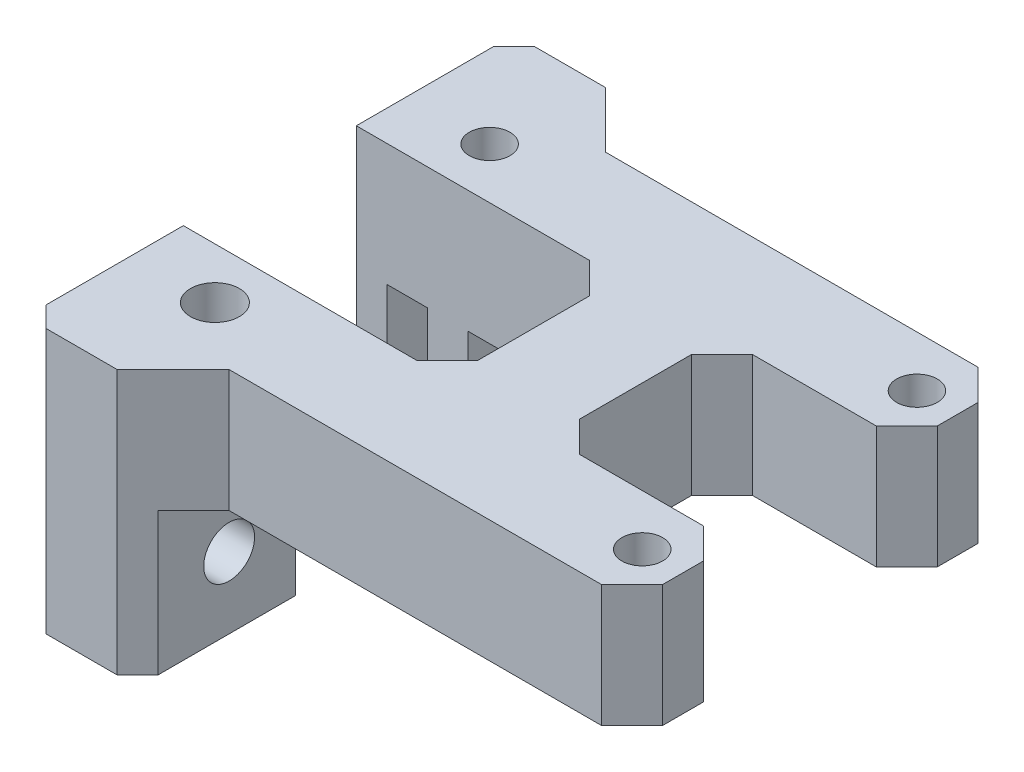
ISO-10303-21;
HEADER;
FILE_DESCRIPTION(('STEP AP214'),'2;1');
FILE_NAME('part.step','',(''),(''),'','','');
FILE_SCHEMA(('AUTOMOTIVE_DESIGN { 1 0 10303 214 1 1 1 1 }'));
ENDSEC;
DATA;
#1=APPLICATION_CONTEXT('core data for automotive mechanical design processes');
#2=APPLICATION_PROTOCOL_DEFINITION('international standard','automotive_design',2000,#1);
#3=PRODUCT_CONTEXT('',#1,'mechanical');
#4=PRODUCT('Part','Part','',(#3));
#5=PRODUCT_RELATED_PRODUCT_CATEGORY('part','',(#4));
#6=PRODUCT_DEFINITION_FORMATION('','',#4);
#7=PRODUCT_DEFINITION_CONTEXT('part definition',#1,'design');
#8=PRODUCT_DEFINITION('design','',#6,#7);
#9=PRODUCT_DEFINITION_SHAPE('','',#8);
#10=(LENGTH_UNIT() NAMED_UNIT(*) SI_UNIT(.MILLI.,.METRE.));
#11=(NAMED_UNIT(*) PLANE_ANGLE_UNIT() SI_UNIT($,.RADIAN.));
#12=(NAMED_UNIT(*) SI_UNIT($,.STERADIAN.) SOLID_ANGLE_UNIT());
#13=UNCERTAINTY_MEASURE_WITH_UNIT(LENGTH_MEASURE(1.E-05),#10,'distance_accuracy_value','');
#14=(GEOMETRIC_REPRESENTATION_CONTEXT(3) GLOBAL_UNCERTAINTY_ASSIGNED_CONTEXT((#13)) GLOBAL_UNIT_ASSIGNED_CONTEXT((#10,
#11,#12)) REPRESENTATION_CONTEXT('',''));
#15=CARTESIAN_POINT('',(0.,0.,0.));
#16=DIRECTION('',(0.,0.,1.));
#17=DIRECTION('',(1.,0.,0.));
#18=AXIS2_PLACEMENT_3D('',#15,#16,#17);
#19=CARTESIAN_POINT('',(-10.08,6.,9.25000000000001));
#20=DIRECTION('',(0.,0.,-1.));
#21=DIRECTION('',(-1.,0.,0.));
#22=AXIS2_PLACEMENT_3D('',#19,#20,#21);
#23=PLANE('',#22);
#24=DIRECTION('',(0.,-1.,0.));
#25=VECTOR('',#24,1.);
#26=CARTESIAN_POINT('',(-8.22000000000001,16.6124926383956,9.25000000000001));
#27=LINE('',#26,#25);
#28=CARTESIAN_POINT('',(-8.22000000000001,6.,9.25000000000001));
#29=VERTEX_POINT('',#28);
#30=CARTESIAN_POINT('',(-8.22000000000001,0.,9.25000000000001));
#31=VERTEX_POINT('',#30);
#32=EDGE_CURVE('E616',#29,#31,#27,.T.);
#33=ORIENTED_EDGE('',*,*,#32,.T.);
#34=DIRECTION('',(1.,0.,0.));
#35=VECTOR('',#34,1.);
#36=CARTESIAN_POINT('',(-10.08,0.,9.25000000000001));
#37=LINE('',#36,#35);
#38=CARTESIAN_POINT('',(10.08,0.,9.25000000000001));
#39=VERTEX_POINT('',#38);
#40=EDGE_CURVE('E408',#31,#39,#37,.T.);
#41=ORIENTED_EDGE('',*,*,#40,.T.);
#42=DIRECTION('',(0.,-1.,0.));
#43=VECTOR('',#42,1.);
#44=CARTESIAN_POINT('',(10.08,6.,9.25000000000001));
#45=LINE('',#44,#43);
#46=CARTESIAN_POINT('',(10.08,6.,9.25000000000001));
#47=VERTEX_POINT('',#46);
#48=EDGE_CURVE('E466',#47,#39,#45,.T.);
#49=ORIENTED_EDGE('',*,*,#48,.F.);
#50=DIRECTION('',(1.,0.,0.));
#51=VECTOR('',#50,1.);
#52=CARTESIAN_POINT('',(-10.08,6.,9.25000000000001));
#53=LINE('',#52,#51);
#54=EDGE_CURVE('E372',#29,#47,#53,.T.);
#55=ORIENTED_EDGE('',*,*,#54,.F.);
#56=EDGE_LOOP('',(#33,#41,#49,#55));
#57=FACE_BOUND('',#56,.T.);
#58=ADVANCED_FACE('F32',(#57),#23,.F.);
#59=CARTESIAN_POINT('',(-10.08,6.,-9.25));
#60=DIRECTION('',(0.,0.,1.));
#61=DIRECTION('',(1.,0.,0.));
#62=AXIS2_PLACEMENT_3D('',#59,#60,#61);
#63=PLANE('',#62);
#64=DIRECTION('',(0.,-1.,0.));
#65=VECTOR('',#64,1.);
#66=CARTESIAN_POINT('',(-8.21999999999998,16.6124926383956,-9.25));
#67=LINE('',#66,#65);
#68=CARTESIAN_POINT('',(-8.21999999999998,6.,-9.25));
#69=VERTEX_POINT('',#68);
#70=CARTESIAN_POINT('',(-8.21999999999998,0.,-9.25));
#71=VERTEX_POINT('',#70);
#72=EDGE_CURVE('E536',#69,#71,#67,.T.);
#73=ORIENTED_EDGE('',*,*,#72,.F.);
#74=DIRECTION('',(-1.,0.,0.));
#75=VECTOR('',#74,1.);
#76=CARTESIAN_POINT('',(-10.08,6.,-9.25));
#77=LINE('',#76,#75);
#78=CARTESIAN_POINT('',(10.08,6.,-9.25));
#79=VERTEX_POINT('',#78);
#80=EDGE_CURVE('E396',#79,#69,#77,.T.);
#81=ORIENTED_EDGE('',*,*,#80,.F.);
#82=DIRECTION('',(0.,-1.,0.));
#83=VECTOR('',#82,1.);
#84=CARTESIAN_POINT('',(10.08,6.,-9.25));
#85=LINE('',#84,#83);
#86=CARTESIAN_POINT('',(10.08,0.,-9.25));
#87=VERTEX_POINT('',#86);
#88=EDGE_CURVE('E399',#79,#87,#85,.T.);
#89=ORIENTED_EDGE('',*,*,#88,.T.);
#90=DIRECTION('',(-1.,0.,0.));
#91=VECTOR('',#90,1.);
#92=CARTESIAN_POINT('',(-10.08,0.,-9.25));
#93=LINE('',#92,#91);
#94=EDGE_CURVE('E364',#87,#71,#93,.T.);
#95=ORIENTED_EDGE('',*,*,#94,.T.);
#96=EDGE_LOOP('',(#73,#81,#89,#95));
#97=FACE_BOUND('',#96,.T.);
#98=ADVANCED_FACE('F776',(#97),#63,.F.);
#99=CARTESIAN_POINT('',(0.,0.,0.));
#100=DIRECTION('',(0.,1.,0.));
#101=DIRECTION('',(0.,0.,1.));
#102=AXIS2_PLACEMENT_3D('',#99,#100,#101);
#103=PLANE('',#102);
#104=CARTESIAN_POINT('',(9.58,0.,-6.74999999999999));
#105=DIRECTION('',(0.,1.,0.));
#106=DIRECTION('',(0.,0.,1.));
#107=AXIS2_PLACEMENT_3D('',#104,#105,#106);
#108=CIRCLE('',#107,1.00000000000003);
#109=CARTESIAN_POINT('',(9.58,0.,-5.74999999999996));
#110=VERTEX_POINT('',#109);
#111=EDGE_CURVE('E352',#110,#110,#108,.T.);
#112=ORIENTED_EDGE('',*,*,#111,.T.);
#113=EDGE_LOOP('',(#112));
#114=FACE_BOUND('',#113,.T.);
#115=CARTESIAN_POINT('',(9.58,0.,6.75000000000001));
#116=DIRECTION('',(0.,1.,0.));
#117=DIRECTION('',(0.,0.,1.));
#118=AXIS2_PLACEMENT_3D('',#115,#116,#117);
#119=CIRCLE('',#118,1.00000000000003);
#120=CARTESIAN_POINT('',(9.58,0.,7.75000000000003));
#121=VERTEX_POINT('',#120);
#122=EDGE_CURVE('E337',#121,#121,#119,.T.);
#123=ORIENTED_EDGE('',*,*,#122,.T.);
#124=EDGE_LOOP('',(#123));
#125=FACE_BOUND('',#124,.T.);
#126=DIRECTION('',(1.,0.,0.));
#127=VECTOR('',#126,1.);
#128=CARTESIAN_POINT('',(-10.08,0.,-4.25));
#129=LINE('',#128,#127);
#130=CARTESIAN_POINT('',(-9.97,0.,-4.25));
#131=VERTEX_POINT('',#130);
#132=CARTESIAN_POINT('',(-4.,0.,-4.25));
#133=VERTEX_POINT('',#132);
#134=EDGE_CURVE('E358',#131,#133,#129,.T.);
#135=ORIENTED_EDGE('',*,*,#134,.F.);
#136=DIRECTION('',(0.,0.,1.));
#137=VECTOR('',#136,1.);
#138=CARTESIAN_POINT('',(-9.97,0.,-4.25));
#139=LINE('',#138,#137);
#140=CARTESIAN_POINT('',(-9.97,0.,-11.));
#141=VERTEX_POINT('',#140);
#142=EDGE_CURVE('E520',#141,#131,#139,.T.);
#143=ORIENTED_EDGE('',*,*,#142,.F.);
#144=DIRECTION('',(-0.707106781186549,0.,-0.707106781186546));
#145=VECTOR('',#144,1.);
#146=CARTESIAN_POINT('',(-10.97,0.,-12.));
#147=LINE('',#146,#145);
#148=EDGE_CURVE('E523',#71,#141,#147,.T.);
#149=ORIENTED_EDGE('',*,*,#148,.F.);
#150=ORIENTED_EDGE('',*,*,#94,.F.);
#151=DIRECTION('',(-0.707106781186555,0.,-0.70710678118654));
#152=VECTOR('',#151,1.);
#153=CARTESIAN_POINT('',(10.08,0.,-9.25));
#154=LINE('',#153,#152);
#155=CARTESIAN_POINT('',(11.58,0.,-7.75000000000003));
#156=VERTEX_POINT('',#155);
#157=EDGE_CURVE('E430',#156,#87,#154,.T.);
#158=ORIENTED_EDGE('',*,*,#157,.F.);
#159=DIRECTION('',(0.,0.,-1.));
#160=VECTOR('',#159,1.);
#161=CARTESIAN_POINT('',(11.58,0.,-7.75000000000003));
#162=LINE('',#161,#160);
#163=CARTESIAN_POINT('',(11.58,0.,-5.74999999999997));
#164=VERTEX_POINT('',#163);
#165=EDGE_CURVE('E428',#164,#156,#162,.T.);
#166=ORIENTED_EDGE('',*,*,#165,.F.);
#167=DIRECTION('',(0.707106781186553,0.,-0.707106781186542));
#168=VECTOR('',#167,1.);
#169=CARTESIAN_POINT('',(11.58,0.,-5.74999999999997));
#170=LINE('',#169,#168);
#171=CARTESIAN_POINT('',(10.08,0.,-4.25));
#172=VERTEX_POINT('',#171);
#173=EDGE_CURVE('E426',#172,#164,#170,.T.);
#174=ORIENTED_EDGE('',*,*,#173,.F.);
#175=DIRECTION('',(1.,0.,0.));
#176=VECTOR('',#175,1.);
#177=CARTESIAN_POINT('',(10.08,0.,-4.25));
#178=LINE('',#177,#176);
#179=CARTESIAN_POINT('',(4.00000000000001,0.,-4.25));
#180=VERTEX_POINT('',#179);
#181=EDGE_CURVE('E424',#180,#172,#178,.T.);
#182=ORIENTED_EDGE('',*,*,#181,.F.);
#183=DIRECTION('',(0.707106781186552,0.,-0.707106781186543));
#184=VECTOR('',#183,1.);
#185=CARTESIAN_POINT('',(2.5,0.,-2.75));
#186=LINE('',#185,#184);
#187=CARTESIAN_POINT('',(2.5,0.,-2.75));
#188=VERTEX_POINT('',#187);
#189=EDGE_CURVE('E422',#188,#180,#186,.T.);
#190=ORIENTED_EDGE('',*,*,#189,.F.);
#191=DIRECTION('',(0.,0.,-1.));
#192=VECTOR('',#191,1.);
#193=CARTESIAN_POINT('',(2.5,0.,-2.75));
#194=LINE('',#193,#192);
#195=CARTESIAN_POINT('',(2.5,0.,2.75));
#196=VERTEX_POINT('',#195);
#197=EDGE_CURVE('E420',#196,#188,#194,.T.);
#198=ORIENTED_EDGE('',*,*,#197,.F.);
#199=DIRECTION('',(-0.707106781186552,0.,-0.707106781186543));
#200=VECTOR('',#199,1.);
#201=CARTESIAN_POINT('',(4.00000000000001,0.,4.25));
#202=LINE('',#201,#200);
#203=CARTESIAN_POINT('',(4.00000000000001,0.,4.25));
#204=VERTEX_POINT('',#203);
#205=EDGE_CURVE('E418',#204,#196,#202,.T.);
#206=ORIENTED_EDGE('',*,*,#205,.F.);
#207=DIRECTION('',(-1.,0.,0.));
#208=VECTOR('',#207,1.);
#209=CARTESIAN_POINT('',(4.00000000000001,0.,4.25));
#210=LINE('',#209,#208);
#211=CARTESIAN_POINT('',(10.08,0.,4.25000000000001));
#212=VERTEX_POINT('',#211);
#213=EDGE_CURVE('E416',#212,#204,#210,.T.);
#214=ORIENTED_EDGE('',*,*,#213,.F.);
#215=DIRECTION('',(-0.707106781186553,0.,-0.707106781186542));
#216=VECTOR('',#215,1.);
#217=CARTESIAN_POINT('',(10.08,0.,4.25000000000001));
#218=LINE('',#217,#216);
#219=CARTESIAN_POINT('',(11.58,0.,5.74999999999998));
#220=VERTEX_POINT('',#219);
#221=EDGE_CURVE('E414',#220,#212,#218,.T.);
#222=ORIENTED_EDGE('',*,*,#221,.F.);
#223=DIRECTION('',(0.,0.,-1.));
#224=VECTOR('',#223,1.);
#225=CARTESIAN_POINT('',(11.58,0.,5.74999999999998));
#226=LINE('',#225,#224);
#227=CARTESIAN_POINT('',(11.58,0.,7.75000000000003));
#228=VERTEX_POINT('',#227);
#229=EDGE_CURVE('E412',#228,#220,#226,.T.);
#230=ORIENTED_EDGE('',*,*,#229,.F.);
#231=DIRECTION('',(0.707106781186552,0.,-0.707106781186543));
#232=VECTOR('',#231,1.);
#233=CARTESIAN_POINT('',(11.58,0.,7.75000000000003));
#234=LINE('',#233,#232);
#235=EDGE_CURVE('E410',#39,#228,#234,.T.);
#236=ORIENTED_EDGE('',*,*,#235,.F.);
#237=ORIENTED_EDGE('',*,*,#40,.F.);
#238=DIRECTION('',(0.707106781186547,0.,-0.707106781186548));
#239=VECTOR('',#238,1.);
#240=CARTESIAN_POINT('',(-10.97,0.,12.));
#241=LINE('',#240,#239);
#242=CARTESIAN_POINT('',(-9.97,0.,11.));
#243=VERTEX_POINT('',#242);
#244=EDGE_CURVE('E622',#243,#31,#241,.T.);
#245=ORIENTED_EDGE('',*,*,#244,.F.);
#246=DIRECTION('',(0.,0.,1.));
#247=VECTOR('',#246,1.);
#248=CARTESIAN_POINT('',(-9.97,0.,11.));
#249=LINE('',#248,#247);
#250=CARTESIAN_POINT('',(-9.97,0.,4.25));
#251=VERTEX_POINT('',#250);
#252=EDGE_CURVE('E315',#251,#243,#249,.T.);
#253=ORIENTED_EDGE('',*,*,#252,.F.);
#254=DIRECTION('',(-1.,0.,0.));
#255=VECTOR('',#254,1.);
#256=CARTESIAN_POINT('',(-4.,0.,4.25));
#257=LINE('',#256,#255);
#258=CARTESIAN_POINT('',(-4.,0.,4.25));
#259=VERTEX_POINT('',#258);
#260=EDGE_CURVE('E327',#259,#251,#257,.T.);
#261=ORIENTED_EDGE('',*,*,#260,.F.);
#262=DIRECTION('',(-0.707106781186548,0.,0.707106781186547));
#263=VECTOR('',#262,1.);
#264=CARTESIAN_POINT('',(-4.,0.,4.25));
#265=LINE('',#264,#263);
#266=CARTESIAN_POINT('',(-2.5,0.,2.75));
#267=VERTEX_POINT('',#266);
#268=EDGE_CURVE('E405',#267,#259,#265,.T.);
#269=ORIENTED_EDGE('',*,*,#268,.F.);
#270=DIRECTION('',(0.,0.,1.));
#271=VECTOR('',#270,1.);
#272=CARTESIAN_POINT('',(-2.5,0.,-2.74999999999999));
#273=LINE('',#272,#271);
#274=CARTESIAN_POINT('',(-2.5,0.,-2.74999999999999));
#275=VERTEX_POINT('',#274);
#276=EDGE_CURVE('E403',#275,#267,#273,.T.);
#277=ORIENTED_EDGE('',*,*,#276,.F.);
#278=DIRECTION('',(0.707106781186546,0.,0.707106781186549));
#279=VECTOR('',#278,1.);
#280=CARTESIAN_POINT('',(-4.,0.,-4.25));
#281=LINE('',#280,#279);
#282=EDGE_CURVE('E401',#133,#275,#281,.T.);
#283=ORIENTED_EDGE('',*,*,#282,.F.);
#284=EDGE_LOOP('',(#135,#143,#149,#150,#158,#166,#174,#182,#190,#198,#206,#214,#222,#230,#236,
#237,#245,#253,#261,#269,#277,#283));
#285=FACE_BOUND('',#284,.T.);
#286=ADVANCED_FACE('F488',(#114,#125,#285),#103,.F.);
#287=CARTESIAN_POINT('',(0.,6.,0.));
#288=DIRECTION('',(0.,1.,0.));
#289=DIRECTION('',(0.,0.,1.));
#290=AXIS2_PLACEMENT_3D('',#287,#288,#289);
#291=PLANE('',#290);
#292=CARTESIAN_POINT('',(-11.42,6.,6.75000000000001));
#293=DIRECTION('',(0.,1.,0.));
#294=DIRECTION('',(0.,0.,1.));
#295=AXIS2_PLACEMENT_3D('',#292,#293,#294);
#296=CIRCLE('',#295,1.2);
#297=CARTESIAN_POINT('',(-11.42,6.,7.95000000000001));
#298=VERTEX_POINT('',#297);
#299=EDGE_CURVE('E294',#298,#298,#296,.T.);
#300=ORIENTED_EDGE('',*,*,#299,.F.);
#301=EDGE_LOOP('',(#300));
#302=FACE_BOUND('',#301,.T.);
#303=CARTESIAN_POINT('',(-11.42,6.,-6.74999999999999));
#304=DIRECTION('',(0.,1.,0.));
#305=DIRECTION('',(0.,0.,1.));
#306=AXIS2_PLACEMENT_3D('',#303,#304,#305);
#307=CIRCLE('',#306,1.00000000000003);
#308=CARTESIAN_POINT('',(-11.42,6.,-5.74999999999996));
#309=VERTEX_POINT('',#308);
#310=EDGE_CURVE('E301',#309,#309,#307,.T.);
#311=ORIENTED_EDGE('',*,*,#310,.F.);
#312=EDGE_LOOP('',(#311));
#313=FACE_BOUND('',#312,.T.);
#314=DIRECTION('',(0.,0.,1.));
#315=VECTOR('',#314,1.);
#316=CARTESIAN_POINT('',(-15.47,6.,-4.25));
#317=LINE('',#316,#315);
#318=CARTESIAN_POINT('',(-15.47,6.,-11.));
#319=VERTEX_POINT('',#318);
#320=CARTESIAN_POINT('',(-15.47,6.,-4.25));
#321=VERTEX_POINT('',#320);
#322=EDGE_CURVE('E626',#319,#321,#317,.T.);
#323=ORIENTED_EDGE('',*,*,#322,.T.);
#324=DIRECTION('',(1.,0.,0.));
#325=VECTOR('',#324,1.);
#326=CARTESIAN_POINT('',(-10.08,6.,-4.25));
#327=LINE('',#326,#325);
#328=CARTESIAN_POINT('',(-4.,6.,-4.25));
#329=VERTEX_POINT('',#328);
#330=EDGE_CURVE('E361',#321,#329,#327,.T.);
#331=ORIENTED_EDGE('',*,*,#330,.T.);
#332=DIRECTION('',(0.707106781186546,0.,0.707106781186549));
#333=VECTOR('',#332,1.);
#334=CARTESIAN_POINT('',(-4.,6.,-4.25));
#335=LINE('',#334,#333);
#336=CARTESIAN_POINT('',(-2.5,6.,-2.74999999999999));
#337=VERTEX_POINT('',#336);
#338=EDGE_CURVE('E363',#329,#337,#335,.T.);
#339=ORIENTED_EDGE('',*,*,#338,.T.);
#340=DIRECTION('',(0.,0.,1.));
#341=VECTOR('',#340,1.);
#342=CARTESIAN_POINT('',(-2.5,6.,-2.74999999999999));
#343=LINE('',#342,#341);
#344=CARTESIAN_POINT('',(-2.5,6.,2.75));
#345=VERTEX_POINT('',#344);
#346=EDGE_CURVE('E366',#337,#345,#343,.T.);
#347=ORIENTED_EDGE('',*,*,#346,.T.);
#348=DIRECTION('',(-0.707106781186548,0.,0.707106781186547));
#349=VECTOR('',#348,1.);
#350=CARTESIAN_POINT('',(-4.,6.,4.25));
#351=LINE('',#350,#349);
#352=CARTESIAN_POINT('',(-4.,6.,4.25));
#353=VERTEX_POINT('',#352);
#354=EDGE_CURVE('E368',#345,#353,#351,.T.);
#355=ORIENTED_EDGE('',*,*,#354,.T.);
#356=DIRECTION('',(-1.,0.,0.));
#357=VECTOR('',#356,1.);
#358=CARTESIAN_POINT('',(-4.,6.,4.25));
#359=LINE('',#358,#357);
#360=CARTESIAN_POINT('',(-15.47,6.,4.25));
#361=VERTEX_POINT('',#360);
#362=EDGE_CURVE('E370',#353,#361,#359,.T.);
#363=ORIENTED_EDGE('',*,*,#362,.T.);
#364=DIRECTION('',(0.,0.,1.));
#365=VECTOR('',#364,1.);
#366=CARTESIAN_POINT('',(-15.47,6.,4.25));
#367=LINE('',#366,#365);
#368=CARTESIAN_POINT('',(-15.47,6.,11.));
#369=VERTEX_POINT('',#368);
#370=EDGE_CURVE('E509',#361,#369,#367,.T.);
#371=ORIENTED_EDGE('',*,*,#370,.T.);
#372=DIRECTION('',(0.707106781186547,0.,0.707106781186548));
#373=VECTOR('',#372,1.);
#374=CARTESIAN_POINT('',(-15.47,6.,11.));
#375=LINE('',#374,#373);
#376=CARTESIAN_POINT('',(-14.47,6.,12.));
#377=VERTEX_POINT('',#376);
#378=EDGE_CURVE('E604',#369,#377,#375,.T.);
#379=ORIENTED_EDGE('',*,*,#378,.T.);
#380=DIRECTION('',(1.,0.,0.));
#381=VECTOR('',#380,1.);
#382=CARTESIAN_POINT('',(-14.47,6.,12.));
#383=LINE('',#382,#381);
#384=CARTESIAN_POINT('',(-10.97,6.,12.));
#385=VERTEX_POINT('',#384);
#386=EDGE_CURVE('E608',#377,#385,#383,.T.);
#387=ORIENTED_EDGE('',*,*,#386,.T.);
#388=DIRECTION('',(0.707106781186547,0.,-0.707106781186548));
#389=VECTOR('',#388,1.);
#390=CARTESIAN_POINT('',(-10.97,6.,12.));
#391=LINE('',#390,#389);
#392=EDGE_CURVE('E613',#385,#29,#391,.T.);
#393=ORIENTED_EDGE('',*,*,#392,.T.);
#394=ORIENTED_EDGE('',*,*,#54,.T.);
#395=DIRECTION('',(0.707106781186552,0.,-0.707106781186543));
#396=VECTOR('',#395,1.);
#397=CARTESIAN_POINT('',(11.58,6.,7.75000000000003));
#398=LINE('',#397,#396);
#399=CARTESIAN_POINT('',(11.58,6.,7.75000000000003));
#400=VERTEX_POINT('',#399);
#401=EDGE_CURVE('E374',#47,#400,#398,.T.);
#402=ORIENTED_EDGE('',*,*,#401,.T.);
#403=DIRECTION('',(0.,0.,-1.));
#404=VECTOR('',#403,1.);
#405=CARTESIAN_POINT('',(11.58,6.,5.74999999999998));
#406=LINE('',#405,#404);
#407=CARTESIAN_POINT('',(11.58,6.,5.74999999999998));
#408=VERTEX_POINT('',#407);
#409=EDGE_CURVE('E376',#400,#408,#406,.T.);
#410=ORIENTED_EDGE('',*,*,#409,.T.);
#411=DIRECTION('',(-0.707106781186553,0.,-0.707106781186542));
#412=VECTOR('',#411,1.);
#413=CARTESIAN_POINT('',(10.08,6.,4.25000000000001));
#414=LINE('',#413,#412);
#415=CARTESIAN_POINT('',(10.08,6.,4.25000000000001));
#416=VERTEX_POINT('',#415);
#417=EDGE_CURVE('E378',#408,#416,#414,.T.);
#418=ORIENTED_EDGE('',*,*,#417,.T.);
#419=DIRECTION('',(-1.,0.,0.));
#420=VECTOR('',#419,1.);
#421=CARTESIAN_POINT('',(4.00000000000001,6.,4.25));
#422=LINE('',#421,#420);
#423=CARTESIAN_POINT('',(4.00000000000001,6.,4.25));
#424=VERTEX_POINT('',#423);
#425=EDGE_CURVE('E380',#416,#424,#422,.T.);
#426=ORIENTED_EDGE('',*,*,#425,.T.);
#427=DIRECTION('',(-0.707106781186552,0.,-0.707106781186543));
#428=VECTOR('',#427,1.);
#429=CARTESIAN_POINT('',(4.00000000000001,6.,4.25));
#430=LINE('',#429,#428);
#431=CARTESIAN_POINT('',(2.5,6.,2.75));
#432=VERTEX_POINT('',#431);
#433=EDGE_CURVE('E382',#424,#432,#430,.T.);
#434=ORIENTED_EDGE('',*,*,#433,.T.);
#435=DIRECTION('',(0.,0.,-1.));
#436=VECTOR('',#435,1.);
#437=CARTESIAN_POINT('',(2.5,6.,-2.75));
#438=LINE('',#437,#436);
#439=CARTESIAN_POINT('',(2.5,6.,-2.75));
#440=VERTEX_POINT('',#439);
#441=EDGE_CURVE('E384',#432,#440,#438,.T.);
#442=ORIENTED_EDGE('',*,*,#441,.T.);
#443=DIRECTION('',(0.707106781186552,0.,-0.707106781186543));
#444=VECTOR('',#443,1.);
#445=CARTESIAN_POINT('',(2.5,6.,-2.75));
#446=LINE('',#445,#444);
#447=CARTESIAN_POINT('',(4.00000000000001,6.,-4.25));
#448=VERTEX_POINT('',#447);
#449=EDGE_CURVE('E386',#440,#448,#446,.T.);
#450=ORIENTED_EDGE('',*,*,#449,.T.);
#451=DIRECTION('',(1.,0.,0.));
#452=VECTOR('',#451,1.);
#453=CARTESIAN_POINT('',(10.08,6.,-4.25));
#454=LINE('',#453,#452);
#455=CARTESIAN_POINT('',(10.08,6.,-4.25));
#456=VERTEX_POINT('',#455);
#457=EDGE_CURVE('E388',#448,#456,#454,.T.);
#458=ORIENTED_EDGE('',*,*,#457,.T.);
#459=DIRECTION('',(0.707106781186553,0.,-0.707106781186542));
#460=VECTOR('',#459,1.);
#461=CARTESIAN_POINT('',(11.58,6.,-5.74999999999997));
#462=LINE('',#461,#460);
#463=CARTESIAN_POINT('',(11.58,6.,-5.74999999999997));
#464=VERTEX_POINT('',#463);
#465=EDGE_CURVE('E390',#456,#464,#462,.T.);
#466=ORIENTED_EDGE('',*,*,#465,.T.);
#467=DIRECTION('',(0.,0.,-1.));
#468=VECTOR('',#467,1.);
#469=CARTESIAN_POINT('',(11.58,6.,-7.75000000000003));
#470=LINE('',#469,#468);
#471=CARTESIAN_POINT('',(11.58,6.,-7.75000000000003));
#472=VERTEX_POINT('',#471);
#473=EDGE_CURVE('E392',#464,#472,#470,.T.);
#474=ORIENTED_EDGE('',*,*,#473,.T.);
#475=DIRECTION('',(-0.707106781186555,0.,-0.70710678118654));
#476=VECTOR('',#475,1.);
#477=CARTESIAN_POINT('',(10.08,6.,-9.25));
#478=LINE('',#477,#476);
#479=EDGE_CURVE('E394',#472,#79,#478,.T.);
#480=ORIENTED_EDGE('',*,*,#479,.T.);
#481=ORIENTED_EDGE('',*,*,#80,.T.);
#482=DIRECTION('',(-0.707106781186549,0.,-0.707106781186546));
#483=VECTOR('',#482,1.);
#484=CARTESIAN_POINT('',(-10.97,6.,-12.));
#485=LINE('',#484,#483);
#486=CARTESIAN_POINT('',(-10.97,6.,-12.));
#487=VERTEX_POINT('',#486);
#488=EDGE_CURVE('E624',#69,#487,#485,.T.);
#489=ORIENTED_EDGE('',*,*,#488,.T.);
#490=DIRECTION('',(-1.,0.,0.));
#491=VECTOR('',#490,1.);
#492=CARTESIAN_POINT('',(-14.47,6.,-12.));
#493=LINE('',#492,#491);
#494=CARTESIAN_POINT('',(-14.47,6.,-12.));
#495=VERTEX_POINT('',#494);
#496=EDGE_CURVE('E632',#487,#495,#493,.T.);
#497=ORIENTED_EDGE('',*,*,#496,.T.);
#498=DIRECTION('',(-0.707106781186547,0.,0.707106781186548));
#499=VECTOR('',#498,1.);
#500=CARTESIAN_POINT('',(-15.47,6.,-11.));
#501=LINE('',#500,#499);
#502=EDGE_CURVE('E629',#495,#319,#501,.T.);
#503=ORIENTED_EDGE('',*,*,#502,.T.);
#504=EDGE_LOOP('',(#323,#331,#339,#347,#355,#363,#371,#379,#387,#393,#394,#402,#410,#418,#426,
#434,#442,#450,#458,#466,#474,#480,#481,#489,#497,#503));
#505=FACE_BOUND('',#504,.T.);
#506=CARTESIAN_POINT('',(9.58,6.,-6.74999999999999));
#507=DIRECTION('',(0.,1.,0.));
#508=DIRECTION('',(0.,0.,1.));
#509=AXIS2_PLACEMENT_3D('',#506,#507,#508);
#510=CIRCLE('',#509,1.00000000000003);
#511=CARTESIAN_POINT('',(9.58,6.,-5.74999999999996));
#512=VERTEX_POINT('',#511);
#513=EDGE_CURVE('E355',#512,#512,#510,.T.);
#514=ORIENTED_EDGE('',*,*,#513,.F.);
#515=EDGE_LOOP('',(#514));
#516=FACE_BOUND('',#515,.T.);
#517=CARTESIAN_POINT('',(9.58,6.,6.75000000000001));
#518=DIRECTION('',(0.,1.,0.));
#519=DIRECTION('',(0.,0.,1.));
#520=AXIS2_PLACEMENT_3D('',#517,#518,#519);
#521=CIRCLE('',#520,1.00000000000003);
#522=CARTESIAN_POINT('',(9.58,6.,7.75000000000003));
#523=VERTEX_POINT('',#522);
#524=EDGE_CURVE('E349',#523,#523,#521,.T.);
#525=ORIENTED_EDGE('',*,*,#524,.F.);
#526=EDGE_LOOP('',(#525));
#527=FACE_BOUND('',#526,.T.);
#528=ADVANCED_FACE('F506',(#302,#313,#505,#516,#527),#291,.T.);
#529=CARTESIAN_POINT('',(-10.08,6.,-4.25));
#530=DIRECTION('',(0.,0.,-1.));
#531=DIRECTION('',(-1.,0.,0.));
#532=AXIS2_PLACEMENT_3D('',#529,#530,#531);
#533=PLANE('',#532);
#534=ORIENTED_EDGE('',*,*,#330,.F.);
#535=DIRECTION('',(0.,1.,0.));
#536=VECTOR('',#535,1.);
#537=CARTESIAN_POINT('',(-15.47,-7.,-4.25));
#538=LINE('',#537,#536);
#539=CARTESIAN_POINT('',(-15.47,-7.,-4.25));
#540=VERTEX_POINT('',#539);
#541=EDGE_CURVE('E552',#540,#321,#538,.T.);
#542=ORIENTED_EDGE('',*,*,#541,.F.);
#543=DIRECTION('',(-1.,0.,0.));
#544=VECTOR('',#543,1.);
#545=CARTESIAN_POINT('',(-13.97,-7.,-4.25));
#546=LINE('',#545,#544);
#547=CARTESIAN_POINT('',(-13.97,-7.,-4.25));
#548=VERTEX_POINT('',#547);
#549=EDGE_CURVE('E644',#548,#540,#546,.T.);
#550=ORIENTED_EDGE('',*,*,#549,.F.);
#551=DIRECTION('',(0.,1.,0.));
#552=VECTOR('',#551,1.);
#553=CARTESIAN_POINT('',(-13.97,-7.,-4.25));
#554=LINE('',#553,#552);
#555=CARTESIAN_POINT('',(-13.97,0.,-4.25));
#556=VERTEX_POINT('',#555);
#557=EDGE_CURVE('E554',#548,#556,#554,.T.);
#558=ORIENTED_EDGE('',*,*,#557,.T.);
#559=DIRECTION('',(1.,0.,0.));
#560=VECTOR('',#559,1.);
#561=CARTESIAN_POINT('',(-10.08,0.,-4.25));
#562=LINE('',#561,#560);
#563=CARTESIAN_POINT('',(-11.97,0.,-4.25));
#564=VERTEX_POINT('',#563);
#565=EDGE_CURVE('E537',#556,#564,#562,.T.);
#566=ORIENTED_EDGE('',*,*,#565,.T.);
#567=DIRECTION('',(0.,1.,0.));
#568=VECTOR('',#567,1.);
#569=CARTESIAN_POINT('',(-11.97,-7.,-4.25));
#570=LINE('',#569,#568);
#571=CARTESIAN_POINT('',(-11.97,-7.,-4.25));
#572=VERTEX_POINT('',#571);
#573=EDGE_CURVE('E545',#572,#564,#570,.T.);
#574=ORIENTED_EDGE('',*,*,#573,.F.);
#575=DIRECTION('',(-1.,0.,0.));
#576=VECTOR('',#575,1.);
#577=CARTESIAN_POINT('',(-9.97,-7.,-4.25));
#578=LINE('',#577,#576);
#579=CARTESIAN_POINT('',(-9.97,-7.,-4.25));
#580=VERTEX_POINT('',#579);
#581=EDGE_CURVE('E655',#580,#572,#578,.T.);
#582=ORIENTED_EDGE('',*,*,#581,.F.);
#583=DIRECTION('',(0.,1.,0.));
#584=VECTOR('',#583,1.);
#585=CARTESIAN_POINT('',(-9.97,-7.,-4.25));
#586=LINE('',#585,#584);
#587=EDGE_CURVE('E518',#580,#131,#586,.T.);
#588=ORIENTED_EDGE('',*,*,#587,.T.);
#589=ORIENTED_EDGE('',*,*,#134,.T.);
#590=DIRECTION('',(0.,-1.,0.));
#591=VECTOR('',#590,1.);
#592=CARTESIAN_POINT('',(-4.,6.,-4.25));
#593=LINE('',#592,#591);
#594=EDGE_CURVE('E11',#329,#133,#593,.T.);
#595=ORIENTED_EDGE('',*,*,#594,.F.);
#596=EDGE_LOOP('',(#534,#542,#550,#558,#566,#574,#582,#588,#589,#595));
#597=FACE_BOUND('',#596,.T.);
#598=ADVANCED_FACE('F34',(#597),#533,.F.);
#599=CARTESIAN_POINT('',(-4.,6.,-4.25));
#600=DIRECTION('',(0.707106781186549,0.,-0.707106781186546));
#601=DIRECTION('',(-0.707106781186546,0.,-0.707106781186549));
#602=AXIS2_PLACEMENT_3D('',#599,#600,#601);
#603=PLANE('',#602);
#604=ORIENTED_EDGE('',*,*,#282,.T.);
#605=DIRECTION('',(0.,-1.,0.));
#606=VECTOR('',#605,1.);
#607=CARTESIAN_POINT('',(-2.5,6.,-2.74999999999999));
#608=LINE('',#607,#606);
#609=EDGE_CURVE('E41',#337,#275,#608,.T.);
#610=ORIENTED_EDGE('',*,*,#609,.F.);
#611=ORIENTED_EDGE('',*,*,#338,.F.);
#612=ORIENTED_EDGE('',*,*,#594,.T.);
#613=EDGE_LOOP('',(#604,#610,#611,#612));
#614=FACE_BOUND('',#613,.T.);
#615=ADVANCED_FACE('F511',(#614),#603,.F.);
#616=CARTESIAN_POINT('',(-2.5,6.,-2.74999999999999));
#617=DIRECTION('',(1.,0.,0.));
#618=DIRECTION('',(0.,0.,-1.));
#619=AXIS2_PLACEMENT_3D('',#616,#617,#618);
#620=PLANE('',#619);
#621=ORIENTED_EDGE('',*,*,#276,.T.);
#622=DIRECTION('',(0.,-1.,0.));
#623=VECTOR('',#622,1.);
#624=CARTESIAN_POINT('',(-2.5,6.,2.75));
#625=LINE('',#624,#623);
#626=EDGE_CURVE('E472',#345,#267,#625,.T.);
#627=ORIENTED_EDGE('',*,*,#626,.F.);
#628=ORIENTED_EDGE('',*,*,#346,.F.);
#629=ORIENTED_EDGE('',*,*,#609,.T.);
#630=EDGE_LOOP('',(#621,#627,#628,#629));
#631=FACE_BOUND('',#630,.T.);
#632=ADVANCED_FACE('F480',(#631),#620,.F.);
#633=CARTESIAN_POINT('',(-4.,6.,4.25));
#634=DIRECTION('',(0.707106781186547,0.,0.707106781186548));
#635=DIRECTION('',(0.707106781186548,0.,-0.707106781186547));
#636=AXIS2_PLACEMENT_3D('',#633,#634,#635);
#637=PLANE('',#636);
#638=ORIENTED_EDGE('',*,*,#268,.T.);
#639=DIRECTION('',(0.,-1.,0.));
#640=VECTOR('',#639,1.);
#641=CARTESIAN_POINT('',(-4.,6.,4.25));
#642=LINE('',#641,#640);
#643=EDGE_CURVE('E469',#353,#259,#642,.T.);
#644=ORIENTED_EDGE('',*,*,#643,.F.);
#645=ORIENTED_EDGE('',*,*,#354,.F.);
#646=ORIENTED_EDGE('',*,*,#626,.T.);
#647=EDGE_LOOP('',(#638,#644,#645,#646));
#648=FACE_BOUND('',#647,.T.);
#649=ADVANCED_FACE('F493',(#648),#637,.F.);
#650=CARTESIAN_POINT('',(-4.,6.,4.25));
#651=DIRECTION('',(0.,0.,1.));
#652=DIRECTION('',(1.,0.,0.));
#653=AXIS2_PLACEMENT_3D('',#650,#651,#652);
#654=PLANE('',#653);
#655=ORIENTED_EDGE('',*,*,#260,.T.);
#656=DIRECTION('',(0.,1.,0.));
#657=VECTOR('',#656,1.);
#658=CARTESIAN_POINT('',(-9.97,-7.,4.25));
#659=LINE('',#658,#657);
#660=CARTESIAN_POINT('',(-9.97,-7.,4.25));
#661=VERTEX_POINT('',#660);
#662=EDGE_CURVE('E329',#661,#251,#659,.T.);
#663=ORIENTED_EDGE('',*,*,#662,.F.);
#664=DIRECTION('',(1.,0.,0.));
#665=VECTOR('',#664,1.);
#666=CARTESIAN_POINT('',(-9.97,-7.,4.25));
#667=LINE('',#666,#665);
#668=CARTESIAN_POINT('',(-11.97,-7.,4.25));
#669=VERTEX_POINT('',#668);
#670=EDGE_CURVE('E565',#669,#661,#667,.T.);
#671=ORIENTED_EDGE('',*,*,#670,.F.);
#672=DIRECTION('',(0.,1.,0.));
#673=VECTOR('',#672,1.);
#674=CARTESIAN_POINT('',(-11.97,-7.,4.25));
#675=LINE('',#674,#673);
#676=CARTESIAN_POINT('',(-11.97,0.,4.25));
#677=VERTEX_POINT('',#676);
#678=EDGE_CURVE('E331',#669,#677,#675,.T.);
#679=ORIENTED_EDGE('',*,*,#678,.T.);
#680=DIRECTION('',(-1.,0.,0.));
#681=VECTOR('',#680,1.);
#682=CARTESIAN_POINT('',(-10.08,0.,4.25));
#683=LINE('',#682,#681);
#684=CARTESIAN_POINT('',(-13.97,0.,4.25));
#685=VERTEX_POINT('',#684);
#686=EDGE_CURVE('E306',#677,#685,#683,.T.);
#687=ORIENTED_EDGE('',*,*,#686,.T.);
#688=DIRECTION('',(0.,1.,0.));
#689=VECTOR('',#688,1.);
#690=CARTESIAN_POINT('',(-13.97,-7.,4.25));
#691=LINE('',#690,#689);
#692=CARTESIAN_POINT('',(-13.97,-7.,4.25));
#693=VERTEX_POINT('',#692);
#694=EDGE_CURVE('E590',#693,#685,#691,.T.);
#695=ORIENTED_EDGE('',*,*,#694,.F.);
#696=DIRECTION('',(1.,0.,0.));
#697=VECTOR('',#696,1.);
#698=CARTESIAN_POINT('',(-13.97,-7.,4.25));
#699=LINE('',#698,#697);
#700=CARTESIAN_POINT('',(-15.47,-7.,4.25));
#701=VERTEX_POINT('',#700);
#702=EDGE_CURVE('E578',#701,#693,#699,.T.);
#703=ORIENTED_EDGE('',*,*,#702,.F.);
#704=DIRECTION('',(0.,1.,0.));
#705=VECTOR('',#704,1.);
#706=CARTESIAN_POINT('',(-15.47,-7.,4.25));
#707=LINE('',#706,#705);
#708=EDGE_CURVE('E501',#701,#361,#707,.T.);
#709=ORIENTED_EDGE('',*,*,#708,.T.);
#710=ORIENTED_EDGE('',*,*,#362,.F.);
#711=ORIENTED_EDGE('',*,*,#643,.T.);
#712=EDGE_LOOP('',(#655,#663,#671,#679,#687,#695,#703,#709,#710,#711));
#713=FACE_BOUND('',#712,.T.);
#714=ADVANCED_FACE('F497',(#713),#654,.F.);
#715=CARTESIAN_POINT('',(11.58,6.,7.75000000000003));
#716=DIRECTION('',(-0.707106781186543,0.,-0.707106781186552));
#717=DIRECTION('',(-0.707106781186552,0.,0.707106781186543));
#718=AXIS2_PLACEMENT_3D('',#715,#716,#717);
#719=PLANE('',#718);
#720=ORIENTED_EDGE('',*,*,#235,.T.);
#721=DIRECTION('',(0.,-1.,0.));
#722=VECTOR('',#721,1.);
#723=CARTESIAN_POINT('',(11.58,6.,7.75000000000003));
#724=LINE('',#723,#722);
#725=EDGE_CURVE('E463',#400,#228,#724,.T.);
#726=ORIENTED_EDGE('',*,*,#725,.F.);
#727=ORIENTED_EDGE('',*,*,#401,.F.);
#728=ORIENTED_EDGE('',*,*,#48,.T.);
#729=EDGE_LOOP('',(#720,#726,#727,#728));
#730=FACE_BOUND('',#729,.T.);
#731=ADVANCED_FACE('F723',(#730),#719,.F.);
#732=CARTESIAN_POINT('',(11.58,6.,5.74999999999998));
#733=DIRECTION('',(-1.,0.,0.));
#734=DIRECTION('',(0.,0.,1.));
#735=AXIS2_PLACEMENT_3D('',#732,#733,#734);
#736=PLANE('',#735);
#737=ORIENTED_EDGE('',*,*,#229,.T.);
#738=DIRECTION('',(0.,-1.,0.));
#739=VECTOR('',#738,1.);
#740=CARTESIAN_POINT('',(11.58,6.,5.74999999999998));
#741=LINE('',#740,#739);
#742=EDGE_CURVE('E460',#408,#220,#741,.T.);
#743=ORIENTED_EDGE('',*,*,#742,.F.);
#744=ORIENTED_EDGE('',*,*,#409,.F.);
#745=ORIENTED_EDGE('',*,*,#725,.T.);
#746=EDGE_LOOP('',(#737,#743,#744,#745));
#747=FACE_BOUND('',#746,.T.);
#748=ADVANCED_FACE('F729',(#747),#736,.F.);
#749=CARTESIAN_POINT('',(10.08,6.,4.25000000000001));
#750=DIRECTION('',(-0.707106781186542,0.,0.707106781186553));
#751=DIRECTION('',(0.707106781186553,0.,0.707106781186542));
#752=AXIS2_PLACEMENT_3D('',#749,#750,#751);
#753=PLANE('',#752);
#754=ORIENTED_EDGE('',*,*,#221,.T.);
#755=DIRECTION('',(0.,-1.,0.));
#756=VECTOR('',#755,1.);
#757=CARTESIAN_POINT('',(10.08,6.,4.25000000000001));
#758=LINE('',#757,#756);
#759=EDGE_CURVE('E457',#416,#212,#758,.T.);
#760=ORIENTED_EDGE('',*,*,#759,.F.);
#761=ORIENTED_EDGE('',*,*,#417,.F.);
#762=ORIENTED_EDGE('',*,*,#742,.T.);
#763=EDGE_LOOP('',(#754,#760,#761,#762));
#764=FACE_BOUND('',#763,.T.);
#765=ADVANCED_FACE('F733',(#764),#753,.F.);
#766=CARTESIAN_POINT('',(4.00000000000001,6.,4.25));
#767=DIRECTION('',(0.,0.,1.));
#768=DIRECTION('',(1.,0.,0.));
#769=AXIS2_PLACEMENT_3D('',#766,#767,#768);
#770=PLANE('',#769);
#771=ORIENTED_EDGE('',*,*,#213,.T.);
#772=DIRECTION('',(0.,-1.,0.));
#773=VECTOR('',#772,1.);
#774=CARTESIAN_POINT('',(4.00000000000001,6.,4.25));
#775=LINE('',#774,#773);
#776=EDGE_CURVE('E454',#424,#204,#775,.T.);
#777=ORIENTED_EDGE('',*,*,#776,.F.);
#778=ORIENTED_EDGE('',*,*,#425,.F.);
#779=ORIENTED_EDGE('',*,*,#759,.T.);
#780=EDGE_LOOP('',(#771,#777,#778,#779));
#781=FACE_BOUND('',#780,.T.);
#782=ADVANCED_FACE('F738',(#781),#770,.F.);
#783=CARTESIAN_POINT('',(4.00000000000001,6.,4.25));
#784=DIRECTION('',(-0.707106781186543,0.,0.707106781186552));
#785=DIRECTION('',(0.707106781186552,0.,0.707106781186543));
#786=AXIS2_PLACEMENT_3D('',#783,#784,#785);
#787=PLANE('',#786);
#788=ORIENTED_EDGE('',*,*,#205,.T.);
#789=DIRECTION('',(0.,-1.,0.));
#790=VECTOR('',#789,1.);
#791=CARTESIAN_POINT('',(2.5,6.,2.75));
#792=LINE('',#791,#790);
#793=EDGE_CURVE('E451',#432,#196,#792,.T.);
#794=ORIENTED_EDGE('',*,*,#793,.F.);
#795=ORIENTED_EDGE('',*,*,#433,.F.);
#796=ORIENTED_EDGE('',*,*,#776,.T.);
#797=EDGE_LOOP('',(#788,#794,#795,#796));
#798=FACE_BOUND('',#797,.T.);
#799=ADVANCED_FACE('F744',(#798),#787,.F.);
#800=CARTESIAN_POINT('',(2.5,6.,-2.75));
#801=DIRECTION('',(-1.,0.,0.));
#802=DIRECTION('',(0.,0.,1.));
#803=AXIS2_PLACEMENT_3D('',#800,#801,#802);
#804=PLANE('',#803);
#805=ORIENTED_EDGE('',*,*,#197,.T.);
#806=DIRECTION('',(0.,-1.,0.));
#807=VECTOR('',#806,1.);
#808=CARTESIAN_POINT('',(2.5,6.,-2.75));
#809=LINE('',#808,#807);
#810=EDGE_CURVE('E448',#440,#188,#809,.T.);
#811=ORIENTED_EDGE('',*,*,#810,.F.);
#812=ORIENTED_EDGE('',*,*,#441,.F.);
#813=ORIENTED_EDGE('',*,*,#793,.T.);
#814=EDGE_LOOP('',(#805,#811,#812,#813));
#815=FACE_BOUND('',#814,.T.);
#816=ADVANCED_FACE('F748',(#815),#804,.F.);
#817=CARTESIAN_POINT('',(2.5,6.,-2.75));
#818=DIRECTION('',(-0.707106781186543,0.,-0.707106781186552));
#819=DIRECTION('',(-0.707106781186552,0.,0.707106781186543));
#820=AXIS2_PLACEMENT_3D('',#817,#818,#819);
#821=PLANE('',#820);
#822=ORIENTED_EDGE('',*,*,#189,.T.);
#823=DIRECTION('',(0.,-1.,0.));
#824=VECTOR('',#823,1.);
#825=CARTESIAN_POINT('',(4.00000000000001,6.,-4.25));
#826=LINE('',#825,#824);
#827=EDGE_CURVE('E445',#448,#180,#826,.T.);
#828=ORIENTED_EDGE('',*,*,#827,.F.);
#829=ORIENTED_EDGE('',*,*,#449,.F.);
#830=ORIENTED_EDGE('',*,*,#810,.T.);
#831=EDGE_LOOP('',(#822,#828,#829,#830));
#832=FACE_BOUND('',#831,.T.);
#833=ADVANCED_FACE('F753',(#832),#821,.F.);
#834=CARTESIAN_POINT('',(10.08,6.,-4.25));
#835=DIRECTION('',(0.,0.,-1.));
#836=DIRECTION('',(-1.,0.,0.));
#837=AXIS2_PLACEMENT_3D('',#834,#835,#836);
#838=PLANE('',#837);
#839=ORIENTED_EDGE('',*,*,#181,.T.);
#840=DIRECTION('',(0.,-1.,0.));
#841=VECTOR('',#840,1.);
#842=CARTESIAN_POINT('',(10.08,6.,-4.25));
#843=LINE('',#842,#841);
#844=EDGE_CURVE('E442',#456,#172,#843,.T.);
#845=ORIENTED_EDGE('',*,*,#844,.F.);
#846=ORIENTED_EDGE('',*,*,#457,.F.);
#847=ORIENTED_EDGE('',*,*,#827,.T.);
#848=EDGE_LOOP('',(#839,#845,#846,#847));
#849=FACE_BOUND('',#848,.T.);
#850=ADVANCED_FACE('F759',(#849),#838,.F.);
#851=CARTESIAN_POINT('',(11.58,6.,-5.74999999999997));
#852=DIRECTION('',(-0.707106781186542,0.,-0.707106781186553));
#853=DIRECTION('',(-0.707106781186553,0.,0.707106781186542));
#854=AXIS2_PLACEMENT_3D('',#851,#852,#853);
#855=PLANE('',#854);
#856=ORIENTED_EDGE('',*,*,#173,.T.);
#857=DIRECTION('',(0.,-1.,0.));
#858=VECTOR('',#857,1.);
#859=CARTESIAN_POINT('',(11.58,6.,-5.74999999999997));
#860=LINE('',#859,#858);
#861=EDGE_CURVE('E439',#464,#164,#860,.T.);
#862=ORIENTED_EDGE('',*,*,#861,.F.);
#863=ORIENTED_EDGE('',*,*,#465,.F.);
#864=ORIENTED_EDGE('',*,*,#844,.T.);
#865=EDGE_LOOP('',(#856,#862,#863,#864));
#866=FACE_BOUND('',#865,.T.);
#867=ADVANCED_FACE('F763',(#866),#855,.F.);
#868=CARTESIAN_POINT('',(11.58,6.,-7.75000000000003));
#869=DIRECTION('',(-1.,0.,0.));
#870=DIRECTION('',(0.,0.,1.));
#871=AXIS2_PLACEMENT_3D('',#868,#869,#870);
#872=PLANE('',#871);
#873=ORIENTED_EDGE('',*,*,#165,.T.);
#874=DIRECTION('',(0.,-1.,0.));
#875=VECTOR('',#874,1.);
#876=CARTESIAN_POINT('',(11.58,6.,-7.75000000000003));
#877=LINE('',#876,#875);
#878=EDGE_CURVE('E436',#472,#156,#877,.T.);
#879=ORIENTED_EDGE('',*,*,#878,.F.);
#880=ORIENTED_EDGE('',*,*,#473,.F.);
#881=ORIENTED_EDGE('',*,*,#861,.T.);
#882=EDGE_LOOP('',(#873,#879,#880,#881));
#883=FACE_BOUND('',#882,.T.);
#884=ADVANCED_FACE('F768',(#883),#872,.F.);
#885=CARTESIAN_POINT('',(10.08,6.,-9.25));
#886=DIRECTION('',(-0.70710678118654,0.,0.707106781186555));
#887=DIRECTION('',(0.707106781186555,0.,0.70710678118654));
#888=AXIS2_PLACEMENT_3D('',#885,#886,#887);
#889=PLANE('',#888);
#890=ORIENTED_EDGE('',*,*,#157,.T.);
#891=ORIENTED_EDGE('',*,*,#88,.F.);
#892=ORIENTED_EDGE('',*,*,#479,.F.);
#893=ORIENTED_EDGE('',*,*,#878,.T.);
#894=EDGE_LOOP('',(#890,#891,#892,#893));
#895=FACE_BOUND('',#894,.T.);
#896=ADVANCED_FACE('F773',(#895),#889,.F.);
#897=CARTESIAN_POINT('',(9.58,6.,-6.74999999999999));
#898=DIRECTION('',(0.,-1.,0.));
#899=DIRECTION('',(0.,0.,-1.));
#900=AXIS2_PLACEMENT_3D('',#897,#898,#899);
#901=CYLINDRICAL_SURFACE('',#900,1.00000000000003);
#902=ORIENTED_EDGE('',*,*,#513,.T.);
#903=EDGE_LOOP('',(#902));
#904=FACE_BOUND('',#903,.T.);
#905=ORIENTED_EDGE('',*,*,#111,.F.);
#906=EDGE_LOOP('',(#905));
#907=FACE_BOUND('',#906,.T.);
#908=ADVANCED_FACE('F820',(#904,#907),#901,.F.);
#909=CARTESIAN_POINT('',(9.58,6.,6.75000000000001));
#910=DIRECTION('',(0.,-1.,0.));
#911=DIRECTION('',(0.,0.,-1.));
#912=AXIS2_PLACEMENT_3D('',#909,#910,#911);
#913=CYLINDRICAL_SURFACE('',#912,1.00000000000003);
#914=ORIENTED_EDGE('',*,*,#524,.T.);
#915=EDGE_LOOP('',(#914));
#916=FACE_BOUND('',#915,.T.);
#917=ORIENTED_EDGE('',*,*,#122,.F.);
#918=EDGE_LOOP('',(#917));
#919=FACE_BOUND('',#918,.T.);
#920=ADVANCED_FACE('F1168',(#916,#919),#913,.F.);
#921=CARTESIAN_POINT('',(-11.97,-7.,10.));
#922=DIRECTION('',(1.,0.,0.));
#923=DIRECTION('',(0.,0.,-1.));
#924=AXIS2_PLACEMENT_3D('',#921,#922,#923);
#925=PLANE('',#924);
#926=CARTESIAN_POINT('',(-11.97,-3.5,7.5));
#927=DIRECTION('',(1.,0.,0.));
#928=DIRECTION('',(0.,0.,-1.));
#929=AXIS2_PLACEMENT_3D('',#926,#927,#928);
#930=CIRCLE('',#929,1.25);
#931=CARTESIAN_POINT('',(-11.97,-3.5,6.25));
#932=VERTEX_POINT('',#931);
#933=EDGE_CURVE('E709',#932,#932,#930,.T.);
#934=ORIENTED_EDGE('',*,*,#933,.T.);
#935=EDGE_LOOP('',(#934));
#936=FACE_BOUND('',#935,.T.);
#937=DIRECTION('',(0.,0.,-1.));
#938=VECTOR('',#937,1.);
#939=CARTESIAN_POINT('',(-11.97,0.,10.));
#940=LINE('',#939,#938);
#941=CARTESIAN_POINT('',(-11.97,0.,10.));
#942=VERTEX_POINT('',#941);
#943=CARTESIAN_POINT('',(-11.97,0.,7.81653645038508));
#944=VERTEX_POINT('',#943);
#945=EDGE_CURVE('E312',#942,#944,#940,.T.);
#946=ORIENTED_EDGE('',*,*,#945,.T.);
#947=CARTESIAN_POINT('',(-11.97,0.,5.68346354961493));
#948=VERTEX_POINT('',#947);
#949=EDGE_CURVE('E291',#944,#948,#940,.T.);
#950=ORIENTED_EDGE('',*,*,#949,.T.);
#951=EDGE_CURVE('E303',#948,#677,#940,.T.);
#952=ORIENTED_EDGE('',*,*,#951,.T.);
#953=ORIENTED_EDGE('',*,*,#678,.F.);
#954=DIRECTION('',(0.,0.,-1.));
#955=VECTOR('',#954,1.);
#956=CARTESIAN_POINT('',(-11.97,-7.,10.));
#957=LINE('',#956,#955);
#958=CARTESIAN_POINT('',(-11.97,-7.,10.));
#959=VERTEX_POINT('',#958);
#960=EDGE_CURVE('E562',#959,#669,#957,.T.);
#961=ORIENTED_EDGE('',*,*,#960,.F.);
#962=DIRECTION('',(0.,1.,0.));
#963=VECTOR('',#962,1.);
#964=CARTESIAN_POINT('',(-11.97,-7.,10.));
#965=LINE('',#964,#963);
#966=EDGE_CURVE('E583',#959,#942,#965,.T.);
#967=ORIENTED_EDGE('',*,*,#966,.T.);
#968=EDGE_LOOP('',(#946,#950,#952,#953,#961,#967));
#969=FACE_BOUND('',#968,.T.);
#970=ADVANCED_FACE('F313',(#936,#969),#925,.F.);
#971=CARTESIAN_POINT('',(-9.97,-7.,11.));
#972=DIRECTION('',(-1.,0.,0.));
#973=DIRECTION('',(0.,0.,1.));
#974=AXIS2_PLACEMENT_3D('',#971,#972,#973);
#975=PLANE('',#974);
#976=CARTESIAN_POINT('',(-9.97,-3.5,7.5));
#977=DIRECTION('',(1.,0.,0.));
#978=DIRECTION('',(0.,0.,-1.));
#979=AXIS2_PLACEMENT_3D('',#976,#977,#978);
#980=CIRCLE('',#979,1.25);
#981=CARTESIAN_POINT('',(-9.97,-3.5,6.25));
#982=VERTEX_POINT('',#981);
#983=EDGE_CURVE('E706',#982,#982,#980,.T.);
#984=ORIENTED_EDGE('',*,*,#983,.F.);
#985=EDGE_LOOP('',(#984));
#986=FACE_BOUND('',#985,.T.);
#987=ORIENTED_EDGE('',*,*,#252,.T.);
#988=DIRECTION('',(0.,1.,0.));
#989=VECTOR('',#988,1.);
#990=CARTESIAN_POINT('',(-9.97,-7.,11.));
#991=LINE('',#990,#989);
#992=CARTESIAN_POINT('',(-9.97,-7.,11.));
#993=VERTEX_POINT('',#992);
#994=EDGE_CURVE('E332',#993,#243,#991,.T.);
#995=ORIENTED_EDGE('',*,*,#994,.F.);
#996=DIRECTION('',(0.,0.,1.));
#997=VECTOR('',#996,1.);
#998=CARTESIAN_POINT('',(-9.97,-7.,11.));
#999=LINE('',#998,#997);
#1000=EDGE_CURVE('E568',#661,#993,#999,.T.);
#1001=ORIENTED_EDGE('',*,*,#1000,.F.);
#1002=ORIENTED_EDGE('',*,*,#662,.T.);
#1003=EDGE_LOOP('',(#987,#995,#1001,#1002));
#1004=FACE_BOUND('',#1003,.T.);
#1005=ADVANCED_FACE('F780',(#986,#1004),#975,.F.);
#1006=CARTESIAN_POINT('',(-10.97,-7.,12.));
#1007=DIRECTION('',(-0.70710678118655,0.,-0.707106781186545));
#1008=DIRECTION('',(-0.707106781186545,0.,0.70710678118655));
#1009=AXIS2_PLACEMENT_3D('',#1006,#1007,#1008);
#1010=PLANE('',#1009);
#1011=ORIENTED_EDGE('',*,*,#994,.T.);
#1012=ORIENTED_EDGE('',*,*,#244,.T.);
#1013=ORIENTED_EDGE('',*,*,#32,.F.);
#1014=ORIENTED_EDGE('',*,*,#392,.F.);
#1015=DIRECTION('',(0.,1.,0.));
#1016=VECTOR('',#1015,1.);
#1017=CARTESIAN_POINT('',(-10.97,-7.,12.));
#1018=LINE('',#1017,#1016);
#1019=CARTESIAN_POINT('',(-10.97,-7.,12.));
#1020=VERTEX_POINT('',#1019);
#1021=EDGE_CURVE('E340',#1020,#385,#1018,.T.);
#1022=ORIENTED_EDGE('',*,*,#1021,.F.);
#1023=DIRECTION('',(-0.707106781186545,0.,0.70710678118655));
#1024=VECTOR('',#1023,1.);
#1025=CARTESIAN_POINT('',(-10.97,-7.,12.));
#1026=LINE('',#1025,#1024);
#1027=EDGE_CURVE('E570',#993,#1020,#1026,.T.);
#1028=ORIENTED_EDGE('',*,*,#1027,.F.);
#1029=EDGE_LOOP('',(#1011,#1012,#1013,#1014,#1022,#1028));
#1030=FACE_BOUND('',#1029,.T.);
#1031=ADVANCED_FACE('F778',(#1030),#1010,.F.);
#1032=CARTESIAN_POINT('',(-14.47,-7.,12.));
#1033=DIRECTION('',(0.,0.,-1.));
#1034=DIRECTION('',(-1.,0.,0.));
#1035=AXIS2_PLACEMENT_3D('',#1032,#1033,#1034);
#1036=PLANE('',#1035);
#1037=ORIENTED_EDGE('',*,*,#1021,.T.);
#1038=ORIENTED_EDGE('',*,*,#386,.F.);
#1039=DIRECTION('',(0.,1.,0.));
#1040=VECTOR('',#1039,1.);
#1041=CARTESIAN_POINT('',(-14.47,-7.,12.));
#1042=LINE('',#1041,#1040);
#1043=CARTESIAN_POINT('',(-14.47,-7.,12.));
#1044=VERTEX_POINT('',#1043);
#1045=EDGE_CURVE('E345',#1044,#377,#1042,.T.);
#1046=ORIENTED_EDGE('',*,*,#1045,.F.);
#1047=DIRECTION('',(-1.,0.,0.));
#1048=VECTOR('',#1047,1.);
#1049=CARTESIAN_POINT('',(-14.47,-7.,12.));
#1050=LINE('',#1049,#1048);
#1051=EDGE_CURVE('E572',#1020,#1044,#1050,.T.);
#1052=ORIENTED_EDGE('',*,*,#1051,.F.);
#1053=EDGE_LOOP('',(#1037,#1038,#1046,#1052));
#1054=FACE_BOUND('',#1053,.T.);
#1055=ADVANCED_FACE('F609',(#1054),#1036,.F.);
#1056=CARTESIAN_POINT('',(-15.47,-7.,11.));
#1057=DIRECTION('',(0.707106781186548,0.,-0.707106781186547));
#1058=DIRECTION('',(-0.707106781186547,0.,-0.707106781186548));
#1059=AXIS2_PLACEMENT_3D('',#1056,#1057,#1058);
#1060=PLANE('',#1059);
#1061=ORIENTED_EDGE('',*,*,#1045,.T.);
#1062=ORIENTED_EDGE('',*,*,#378,.F.);
#1063=DIRECTION('',(0.,1.,0.));
#1064=VECTOR('',#1063,1.);
#1065=CARTESIAN_POINT('',(-15.47,-7.,11.));
#1066=LINE('',#1065,#1064);
#1067=CARTESIAN_POINT('',(-15.47,-7.,11.));
#1068=VERTEX_POINT('',#1067);
#1069=EDGE_CURVE('E596',#1068,#369,#1066,.T.);
#1070=ORIENTED_EDGE('',*,*,#1069,.F.);
#1071=DIRECTION('',(-0.707106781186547,0.,-0.707106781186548));
#1072=VECTOR('',#1071,1.);
#1073=CARTESIAN_POINT('',(-15.47,-7.,11.));
#1074=LINE('',#1073,#1072);
#1075=EDGE_CURVE('E574',#1044,#1068,#1074,.T.);
#1076=ORIENTED_EDGE('',*,*,#1075,.F.);
#1077=EDGE_LOOP('',(#1061,#1062,#1070,#1076));
#1078=FACE_BOUND('',#1077,.T.);
#1079=ADVANCED_FACE('F602',(#1078),#1060,.F.);
#1080=CARTESIAN_POINT('',(-15.47,-7.,11.));
#1081=DIRECTION('',(1.,0.,0.));
#1082=DIRECTION('',(0.,0.,-1.));
#1083=AXIS2_PLACEMENT_3D('',#1080,#1081,#1082);
#1084=PLANE('',#1083);
#1085=CARTESIAN_POINT('',(-15.47,-3.5,7.5));
#1086=DIRECTION('',(1.,0.,0.));
#1087=DIRECTION('',(0.,0.,-1.));
#1088=AXIS2_PLACEMENT_3D('',#1085,#1086,#1087);
#1089=CIRCLE('',#1088,0.750000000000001);
#1090=CARTESIAN_POINT('',(-15.47,-3.5,6.74999999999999));
#1091=VERTEX_POINT('',#1090);
#1092=EDGE_CURVE('E699',#1091,#1091,#1089,.T.);
#1093=ORIENTED_EDGE('',*,*,#1092,.T.);
#1094=EDGE_LOOP('',(#1093));
#1095=FACE_BOUND('',#1094,.T.);
#1096=ORIENTED_EDGE('',*,*,#1069,.T.);
#1097=ORIENTED_EDGE('',*,*,#370,.F.);
#1098=ORIENTED_EDGE('',*,*,#708,.F.);
#1099=DIRECTION('',(0.,0.,-1.));
#1100=VECTOR('',#1099,1.);
#1101=CARTESIAN_POINT('',(-15.47,-7.,11.));
#1102=LINE('',#1101,#1100);
#1103=EDGE_CURVE('E576',#1068,#701,#1102,.T.);
#1104=ORIENTED_EDGE('',*,*,#1103,.F.);
#1105=EDGE_LOOP('',(#1096,#1097,#1098,#1104));
#1106=FACE_BOUND('',#1105,.T.);
#1107=ADVANCED_FACE('F931',(#1095,#1106),#1084,.F.);
#1108=CARTESIAN_POINT('',(-13.97,-7.,10.));
#1109=DIRECTION('',(-1.,0.,0.));
#1110=DIRECTION('',(0.,0.,1.));
#1111=AXIS2_PLACEMENT_3D('',#1108,#1109,#1110);
#1112=PLANE('',#1111);
#1113=CARTESIAN_POINT('',(-13.97,-3.5,7.5));
#1114=DIRECTION('',(1.,0.,0.));
#1115=DIRECTION('',(0.,0.,-1.));
#1116=AXIS2_PLACEMENT_3D('',#1113,#1114,#1115);
#1117=CIRCLE('',#1116,0.750000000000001);
#1118=CARTESIAN_POINT('',(-13.97,-3.5,6.74999999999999));
#1119=VERTEX_POINT('',#1118);
#1120=EDGE_CURVE('E696',#1119,#1119,#1117,.T.);
#1121=ORIENTED_EDGE('',*,*,#1120,.F.);
#1122=EDGE_LOOP('',(#1121));
#1123=FACE_BOUND('',#1122,.T.);
#1124=DIRECTION('',(0.,0.,1.));
#1125=VECTOR('',#1124,1.);
#1126=CARTESIAN_POINT('',(-13.97,0.,10.));
#1127=LINE('',#1126,#1125);
#1128=CARTESIAN_POINT('',(-13.97,0.,10.));
#1129=VERTEX_POINT('',#1128);
#1130=EDGE_CURVE('E322',#685,#1129,#1127,.T.);
#1131=ORIENTED_EDGE('',*,*,#1130,.T.);
#1132=DIRECTION('',(0.,1.,0.));
#1133=VECTOR('',#1132,1.);
#1134=CARTESIAN_POINT('',(-13.97,-7.,10.));
#1135=LINE('',#1134,#1133);
#1136=CARTESIAN_POINT('',(-13.97,-7.,10.));
#1137=VERTEX_POINT('',#1136);
#1138=EDGE_CURVE('E586',#1137,#1129,#1135,.T.);
#1139=ORIENTED_EDGE('',*,*,#1138,.F.);
#1140=DIRECTION('',(0.,0.,1.));
#1141=VECTOR('',#1140,1.);
#1142=CARTESIAN_POINT('',(-13.97,-7.,10.));
#1143=LINE('',#1142,#1141);
#1144=EDGE_CURVE('E579',#693,#1137,#1143,.T.);
#1145=ORIENTED_EDGE('',*,*,#1144,.F.);
#1146=ORIENTED_EDGE('',*,*,#694,.T.);
#1147=EDGE_LOOP('',(#1131,#1139,#1145,#1146));
#1148=FACE_BOUND('',#1147,.T.);
#1149=ADVANCED_FACE('F943',(#1123,#1148),#1112,.F.);
#1150=CARTESIAN_POINT('',(-13.97,-7.,10.));
#1151=DIRECTION('',(0.,0.,1.));
#1152=DIRECTION('',(1.,0.,0.));
#1153=AXIS2_PLACEMENT_3D('',#1150,#1151,#1152);
#1154=PLANE('',#1153);
#1155=DIRECTION('',(1.,0.,0.));
#1156=VECTOR('',#1155,1.);
#1157=CARTESIAN_POINT('',(-13.97,0.,10.));
#1158=LINE('',#1157,#1156);
#1159=EDGE_CURVE('E566',#1129,#942,#1158,.T.);
#1160=ORIENTED_EDGE('',*,*,#1159,.T.);
#1161=ORIENTED_EDGE('',*,*,#966,.F.);
#1162=DIRECTION('',(1.,0.,0.));
#1163=VECTOR('',#1162,1.);
#1164=CARTESIAN_POINT('',(-13.97,-7.,10.));
#1165=LINE('',#1164,#1163);
#1166=EDGE_CURVE('E318',#1137,#959,#1165,.T.);
#1167=ORIENTED_EDGE('',*,*,#1166,.F.);
#1168=ORIENTED_EDGE('',*,*,#1138,.T.);
#1169=EDGE_LOOP('',(#1160,#1161,#1167,#1168));
#1170=FACE_BOUND('',#1169,.T.);
#1171=ADVANCED_FACE('F1129',(#1170),#1154,.F.);
#1172=CARTESIAN_POINT('',(0.,-7.,0.));
#1173=DIRECTION('',(0.,1.,0.));
#1174=DIRECTION('',(0.,0.,1.));
#1175=AXIS2_PLACEMENT_3D('',#1172,#1173,#1174);
#1176=PLANE('',#1175);
#1177=ORIENTED_EDGE('',*,*,#960,.T.);
#1178=ORIENTED_EDGE('',*,*,#670,.T.);
#1179=ORIENTED_EDGE('',*,*,#1000,.T.);
#1180=ORIENTED_EDGE('',*,*,#1027,.T.);
#1181=ORIENTED_EDGE('',*,*,#1051,.T.);
#1182=ORIENTED_EDGE('',*,*,#1075,.T.);
#1183=ORIENTED_EDGE('',*,*,#1103,.T.);
#1184=ORIENTED_EDGE('',*,*,#702,.T.);
#1185=ORIENTED_EDGE('',*,*,#1144,.T.);
#1186=ORIENTED_EDGE('',*,*,#1166,.T.);
#1187=EDGE_LOOP('',(#1177,#1178,#1179,#1180,#1181,#1182,#1183,#1184,#1185,#1186));
#1188=FACE_BOUND('',#1187,.T.);
#1189=ADVANCED_FACE('F1121',(#1188),#1176,.F.);
#1190=CARTESIAN_POINT('',(-11.97,-7.,-4.25));
#1191=DIRECTION('',(1.,0.,0.));
#1192=DIRECTION('',(0.,0.,-1.));
#1193=AXIS2_PLACEMENT_3D('',#1190,#1191,#1192);
#1194=PLANE('',#1193);
#1195=CARTESIAN_POINT('',(-11.97,-3.5,-7.5));
#1196=DIRECTION('',(1.,0.,0.));
#1197=DIRECTION('',(0.,0.,-1.));
#1198=AXIS2_PLACEMENT_3D('',#1195,#1196,#1197);
#1199=CIRCLE('',#1198,1.25);
#1200=CARTESIAN_POINT('',(-11.97,-3.5,-8.74999999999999));
#1201=VERTEX_POINT('',#1200);
#1202=EDGE_CURVE('E703',#1201,#1201,#1199,.T.);
#1203=ORIENTED_EDGE('',*,*,#1202,.T.);
#1204=EDGE_LOOP('',(#1203));
#1205=FACE_BOUND('',#1204,.T.);
#1206=DIRECTION('',(0.,0.,-1.));
#1207=VECTOR('',#1206,1.);
#1208=CARTESIAN_POINT('',(-11.97,0.,-4.25));
#1209=LINE('',#1208,#1207);
#1210=CARTESIAN_POINT('',(-11.97,0.,-5.91483534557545));
#1211=VERTEX_POINT('',#1210);
#1212=EDGE_CURVE('E657',#564,#1211,#1209,.T.);
#1213=ORIENTED_EDGE('',*,*,#1212,.T.);
#1214=CARTESIAN_POINT('',(-11.97,0.,-7.58516465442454));
#1215=VERTEX_POINT('',#1214);
#1216=EDGE_CURVE('E661',#1211,#1215,#1209,.T.);
#1217=ORIENTED_EDGE('',*,*,#1216,.T.);
#1218=CARTESIAN_POINT('',(-11.97,0.,-10.));
#1219=VERTEX_POINT('',#1218);
#1220=EDGE_CURVE('E628',#1215,#1219,#1209,.T.);
#1221=ORIENTED_EDGE('',*,*,#1220,.T.);
#1222=DIRECTION('',(0.,1.,0.));
#1223=VECTOR('',#1222,1.);
#1224=CARTESIAN_POINT('',(-11.97,-7.,-10.));
#1225=LINE('',#1224,#1223);
#1226=CARTESIAN_POINT('',(-11.97,-7.,-10.));
#1227=VERTEX_POINT('',#1226);
#1228=EDGE_CURVE('E310',#1227,#1219,#1225,.T.);
#1229=ORIENTED_EDGE('',*,*,#1228,.F.);
#1230=DIRECTION('',(0.,0.,-1.));
#1231=VECTOR('',#1230,1.);
#1232=CARTESIAN_POINT('',(-11.97,-7.,-4.25));
#1233=LINE('',#1232,#1231);
#1234=EDGE_CURVE('E526',#572,#1227,#1233,.T.);
#1235=ORIENTED_EDGE('',*,*,#1234,.F.);
#1236=ORIENTED_EDGE('',*,*,#573,.T.);
#1237=EDGE_LOOP('',(#1213,#1217,#1221,#1229,#1235,#1236));
#1238=FACE_BOUND('',#1237,.T.);
#1239=ADVANCED_FACE('F669',(#1205,#1238),#1194,.F.);
#1240=CARTESIAN_POINT('',(-11.97,-7.,-10.));
#1241=DIRECTION('',(0.,0.,-1.));
#1242=DIRECTION('',(-1.,0.,0.));
#1243=AXIS2_PLACEMENT_3D('',#1240,#1241,#1242);
#1244=PLANE('',#1243);
#1245=DIRECTION('',(-1.,0.,0.));
#1246=VECTOR('',#1245,1.);
#1247=CARTESIAN_POINT('',(-11.97,0.,-10.));
#1248=LINE('',#1247,#1246);
#1249=CARTESIAN_POINT('',(-13.97,0.,-10.));
#1250=VERTEX_POINT('',#1249);
#1251=EDGE_CURVE('E660',#1219,#1250,#1248,.T.);
#1252=ORIENTED_EDGE('',*,*,#1251,.T.);
#1253=DIRECTION('',(0.,1.,0.));
#1254=VECTOR('',#1253,1.);
#1255=CARTESIAN_POINT('',(-13.97,-7.,-10.));
#1256=LINE('',#1255,#1254);
#1257=CARTESIAN_POINT('',(-13.97,-7.,-10.));
#1258=VERTEX_POINT('',#1257);
#1259=EDGE_CURVE('E557',#1258,#1250,#1256,.T.);
#1260=ORIENTED_EDGE('',*,*,#1259,.F.);
#1261=DIRECTION('',(-1.,0.,0.));
#1262=VECTOR('',#1261,1.);
#1263=CARTESIAN_POINT('',(-11.97,-7.,-10.));
#1264=LINE('',#1263,#1262);
#1265=EDGE_CURVE('E640',#1227,#1258,#1264,.T.);
#1266=ORIENTED_EDGE('',*,*,#1265,.F.);
#1267=ORIENTED_EDGE('',*,*,#1228,.T.);
#1268=EDGE_LOOP('',(#1252,#1260,#1266,#1267));
#1269=FACE_BOUND('',#1268,.T.);
#1270=ADVANCED_FACE('F683',(#1269),#1244,.F.);
#1271=CARTESIAN_POINT('',(-13.97,-7.,-10.));
#1272=DIRECTION('',(-1.,0.,0.));
#1273=DIRECTION('',(0.,0.,1.));
#1274=AXIS2_PLACEMENT_3D('',#1271,#1272,#1273);
#1275=PLANE('',#1274);
#1276=CARTESIAN_POINT('',(-13.97,-3.5,-7.5));
#1277=DIRECTION('',(1.,0.,0.));
#1278=DIRECTION('',(0.,0.,-1.));
#1279=AXIS2_PLACEMENT_3D('',#1276,#1277,#1278);
#1280=CIRCLE('',#1279,0.749999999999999);
#1281=CARTESIAN_POINT('',(-13.97,-3.5,-8.25));
#1282=VERTEX_POINT('',#1281);
#1283=EDGE_CURVE('E691',#1282,#1282,#1280,.T.);
#1284=ORIENTED_EDGE('',*,*,#1283,.F.);
#1285=EDGE_LOOP('',(#1284));
#1286=FACE_BOUND('',#1285,.T.);
#1287=DIRECTION('',(0.,0.,1.));
#1288=VECTOR('',#1287,1.);
#1289=CARTESIAN_POINT('',(-13.97,0.,-10.));
#1290=LINE('',#1289,#1288);
#1291=EDGE_CURVE('E527',#1250,#556,#1290,.T.);
#1292=ORIENTED_EDGE('',*,*,#1291,.T.);
#1293=ORIENTED_EDGE('',*,*,#557,.F.);
#1294=DIRECTION('',(0.,0.,1.));
#1295=VECTOR('',#1294,1.);
#1296=CARTESIAN_POINT('',(-13.97,-7.,-10.));
#1297=LINE('',#1296,#1295);
#1298=EDGE_CURVE('E642',#1258,#548,#1297,.T.);
#1299=ORIENTED_EDGE('',*,*,#1298,.F.);
#1300=ORIENTED_EDGE('',*,*,#1259,.T.);
#1301=EDGE_LOOP('',(#1292,#1293,#1299,#1300));
#1302=FACE_BOUND('',#1301,.T.);
#1303=ADVANCED_FACE('F679',(#1286,#1302),#1275,.F.);
#1304=CARTESIAN_POINT('',(-15.47,-7.,-4.25));
#1305=DIRECTION('',(1.,0.,0.));
#1306=DIRECTION('',(0.,0.,-1.));
#1307=AXIS2_PLACEMENT_3D('',#1304,#1305,#1306);
#1308=PLANE('',#1307);
#1309=CARTESIAN_POINT('',(-15.47,-3.5,-7.5));
#1310=DIRECTION('',(1.,0.,0.));
#1311=DIRECTION('',(0.,0.,-1.));
#1312=AXIS2_PLACEMENT_3D('',#1309,#1310,#1311);
#1313=CIRCLE('',#1312,0.749999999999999);
#1314=CARTESIAN_POINT('',(-15.47,-3.5,-8.25));
#1315=VERTEX_POINT('',#1314);
#1316=EDGE_CURVE('E36',#1315,#1315,#1313,.T.);
#1317=ORIENTED_EDGE('',*,*,#1316,.T.);
#1318=EDGE_LOOP('',(#1317));
#1319=FACE_BOUND('',#1318,.T.);
#1320=ORIENTED_EDGE('',*,*,#541,.T.);
#1321=ORIENTED_EDGE('',*,*,#322,.F.);
#1322=DIRECTION('',(0.,1.,0.));
#1323=VECTOR('',#1322,1.);
#1324=CARTESIAN_POINT('',(-15.47,-7.,-11.));
#1325=LINE('',#1324,#1323);
#1326=CARTESIAN_POINT('',(-15.47,-7.,-11.));
#1327=VERTEX_POINT('',#1326);
#1328=EDGE_CURVE('E550',#1327,#319,#1325,.T.);
#1329=ORIENTED_EDGE('',*,*,#1328,.F.);
#1330=DIRECTION('',(0.,0.,-1.));
#1331=VECTOR('',#1330,1.);
#1332=CARTESIAN_POINT('',(-15.47,-7.,-4.25));
#1333=LINE('',#1332,#1331);
#1334=EDGE_CURVE('E646',#540,#1327,#1333,.T.);
#1335=ORIENTED_EDGE('',*,*,#1334,.F.);
#1336=EDGE_LOOP('',(#1320,#1321,#1329,#1335));
#1337=FACE_BOUND('',#1336,.T.);
#1338=ADVANCED_FACE('F952',(#1319,#1337),#1308,.F.);
#1339=CARTESIAN_POINT('',(-15.47,-7.,-11.));
#1340=DIRECTION('',(0.707106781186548,0.,0.707106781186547));
#1341=DIRECTION('',(0.707106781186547,0.,-0.707106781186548));
#1342=AXIS2_PLACEMENT_3D('',#1339,#1340,#1341);
#1343=PLANE('',#1342);
#1344=ORIENTED_EDGE('',*,*,#1328,.T.);
#1345=ORIENTED_EDGE('',*,*,#502,.F.);
#1346=DIRECTION('',(0.,1.,0.));
#1347=VECTOR('',#1346,1.);
#1348=CARTESIAN_POINT('',(-14.47,-7.,-12.));
#1349=LINE('',#1348,#1347);
#1350=CARTESIAN_POINT('',(-14.47,-7.,-12.));
#1351=VERTEX_POINT('',#1350);
#1352=EDGE_CURVE('E543',#1351,#495,#1349,.T.);
#1353=ORIENTED_EDGE('',*,*,#1352,.F.);
#1354=DIRECTION('',(0.707106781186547,0.,-0.707106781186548));
#1355=VECTOR('',#1354,1.);
#1356=CARTESIAN_POINT('',(-15.47,-7.,-11.));
#1357=LINE('',#1356,#1355);
#1358=EDGE_CURVE('E648',#1327,#1351,#1357,.T.);
#1359=ORIENTED_EDGE('',*,*,#1358,.F.);
#1360=EDGE_LOOP('',(#1344,#1345,#1353,#1359));
#1361=FACE_BOUND('',#1360,.T.);
#1362=ADVANCED_FACE('F959',(#1361),#1343,.F.);
#1363=CARTESIAN_POINT('',(-14.47,-7.,-12.));
#1364=DIRECTION('',(0.,0.,1.));
#1365=DIRECTION('',(1.,0.,0.));
#1366=AXIS2_PLACEMENT_3D('',#1363,#1364,#1365);
#1367=PLANE('',#1366);
#1368=ORIENTED_EDGE('',*,*,#1352,.T.);
#1369=ORIENTED_EDGE('',*,*,#496,.F.);
#1370=DIRECTION('',(0.,1.,0.));
#1371=VECTOR('',#1370,1.);
#1372=CARTESIAN_POINT('',(-10.97,-7.,-12.));
#1373=LINE('',#1372,#1371);
#1374=CARTESIAN_POINT('',(-10.97,-7.,-12.));
#1375=VERTEX_POINT('',#1374);
#1376=EDGE_CURVE('E541',#1375,#487,#1373,.T.);
#1377=ORIENTED_EDGE('',*,*,#1376,.F.);
#1378=DIRECTION('',(1.,0.,0.));
#1379=VECTOR('',#1378,1.);
#1380=CARTESIAN_POINT('',(-14.47,-7.,-12.));
#1381=LINE('',#1380,#1379);
#1382=EDGE_CURVE('E650',#1351,#1375,#1381,.T.);
#1383=ORIENTED_EDGE('',*,*,#1382,.F.);
#1384=EDGE_LOOP('',(#1368,#1369,#1377,#1383));
#1385=FACE_BOUND('',#1384,.T.);
#1386=ADVANCED_FACE('F974',(#1385),#1367,.F.);
#1387=CARTESIAN_POINT('',(-9.97,-7.,-11.));
#1388=DIRECTION('',(-0.707106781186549,0.,0.707106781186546));
#1389=DIRECTION('',(0.707106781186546,0.,0.707106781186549));
#1390=AXIS2_PLACEMENT_3D('',#1387,#1388,#1389);
#1391=PLANE('',#1390);
#1392=ORIENTED_EDGE('',*,*,#1376,.T.);
#1393=ORIENTED_EDGE('',*,*,#488,.F.);
#1394=ORIENTED_EDGE('',*,*,#72,.T.);
#1395=ORIENTED_EDGE('',*,*,#148,.T.);
#1396=DIRECTION('',(0.,1.,0.));
#1397=VECTOR('',#1396,1.);
#1398=CARTESIAN_POINT('',(-9.97,-7.,-11.));
#1399=LINE('',#1398,#1397);
#1400=CARTESIAN_POINT('',(-9.97,-7.,-11.));
#1401=VERTEX_POINT('',#1400);
#1402=EDGE_CURVE('E533',#1401,#141,#1399,.T.);
#1403=ORIENTED_EDGE('',*,*,#1402,.F.);
#1404=DIRECTION('',(0.707106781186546,0.,0.707106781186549));
#1405=VECTOR('',#1404,1.);
#1406=CARTESIAN_POINT('',(-9.97,-7.,-11.));
#1407=LINE('',#1406,#1405);
#1408=EDGE_CURVE('E652',#1375,#1401,#1407,.T.);
#1409=ORIENTED_EDGE('',*,*,#1408,.F.);
#1410=EDGE_LOOP('',(#1392,#1393,#1394,#1395,#1403,#1409));
#1411=FACE_BOUND('',#1410,.T.);
#1412=ADVANCED_FACE('F531',(#1411),#1391,.F.);
#1413=CARTESIAN_POINT('',(-9.97,-7.,-4.25));
#1414=DIRECTION('',(-1.,0.,0.));
#1415=DIRECTION('',(0.,0.,1.));
#1416=AXIS2_PLACEMENT_3D('',#1413,#1414,#1415);
#1417=PLANE('',#1416);
#1418=CARTESIAN_POINT('',(-9.97,-3.5,-7.5));
#1419=DIRECTION('',(1.,0.,0.));
#1420=DIRECTION('',(0.,0.,-1.));
#1421=AXIS2_PLACEMENT_3D('',#1418,#1419,#1420);
#1422=CIRCLE('',#1421,1.25);
#1423=CARTESIAN_POINT('',(-9.97,-3.5,-8.75));
#1424=VERTEX_POINT('',#1423);
#1425=EDGE_CURVE('E702',#1424,#1424,#1422,.T.);
#1426=ORIENTED_EDGE('',*,*,#1425,.F.);
#1427=EDGE_LOOP('',(#1426));
#1428=FACE_BOUND('',#1427,.T.);
#1429=ORIENTED_EDGE('',*,*,#142,.T.);
#1430=ORIENTED_EDGE('',*,*,#587,.F.);
#1431=DIRECTION('',(0.,0.,1.));
#1432=VECTOR('',#1431,1.);
#1433=CARTESIAN_POINT('',(-9.97,-7.,-4.25));
#1434=LINE('',#1433,#1432);
#1435=EDGE_CURVE('E540',#1401,#580,#1434,.T.);
#1436=ORIENTED_EDGE('',*,*,#1435,.F.);
#1437=ORIENTED_EDGE('',*,*,#1402,.T.);
#1438=EDGE_LOOP('',(#1429,#1430,#1436,#1437));
#1439=FACE_BOUND('',#1438,.T.);
#1440=ADVANCED_FACE('F539',(#1428,#1439),#1417,.F.);
#1441=CARTESIAN_POINT('',(0.,-7.,0.));
#1442=DIRECTION('',(0.,1.,0.));
#1443=DIRECTION('',(0.,0.,1.));
#1444=AXIS2_PLACEMENT_3D('',#1441,#1442,#1443);
#1445=PLANE('',#1444);
#1446=ORIENTED_EDGE('',*,*,#1234,.T.);
#1447=ORIENTED_EDGE('',*,*,#1265,.T.);
#1448=ORIENTED_EDGE('',*,*,#1298,.T.);
#1449=ORIENTED_EDGE('',*,*,#549,.T.);
#1450=ORIENTED_EDGE('',*,*,#1334,.T.);
#1451=ORIENTED_EDGE('',*,*,#1358,.T.);
#1452=ORIENTED_EDGE('',*,*,#1382,.T.);
#1453=ORIENTED_EDGE('',*,*,#1408,.T.);
#1454=ORIENTED_EDGE('',*,*,#1435,.T.);
#1455=ORIENTED_EDGE('',*,*,#581,.T.);
#1456=EDGE_LOOP('',(#1446,#1447,#1448,#1449,#1450,#1451,#1452,#1453,#1454,#1455));
#1457=FACE_BOUND('',#1456,.T.);
#1458=ADVANCED_FACE('F1009',(#1457),#1445,.F.);
#1459=CARTESIAN_POINT('',(0.,0.,0.));
#1460=DIRECTION('',(0.,-1.,0.));
#1461=DIRECTION('',(0.,0.,-1.));
#1462=AXIS2_PLACEMENT_3D('',#1459,#1460,#1461);
#1463=PLANE('',#1462);
#1464=CARTESIAN_POINT('',(-11.42,0.,-6.74999999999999));
#1465=DIRECTION('',(0.,1.,0.));
#1466=DIRECTION('',(0.,0.,1.));
#1467=AXIS2_PLACEMENT_3D('',#1464,#1465,#1466);
#1468=CIRCLE('',#1467,1.00000000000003);
#1469=EDGE_CURVE('E685',#1211,#1215,#1468,.F.);
#1470=ORIENTED_EDGE('',*,*,#1469,.F.);
#1471=ORIENTED_EDGE('',*,*,#1212,.F.);
#1472=ORIENTED_EDGE('',*,*,#565,.F.);
#1473=ORIENTED_EDGE('',*,*,#1291,.F.);
#1474=ORIENTED_EDGE('',*,*,#1251,.F.);
#1475=ORIENTED_EDGE('',*,*,#1220,.F.);
#1476=EDGE_LOOP('',(#1470,#1471,#1472,#1473,#1474,#1475));
#1477=FACE_BOUND('',#1476,.T.);
#1478=ADVANCED_FACE('F676',(#1477),#1463,.T.);
#1479=ORIENTED_EDGE('',*,*,#951,.F.);
#1480=CARTESIAN_POINT('',(-11.42,0.,6.75000000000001));
#1481=DIRECTION('',(0.,1.,0.));
#1482=DIRECTION('',(0.,0.,1.));
#1483=AXIS2_PLACEMENT_3D('',#1480,#1481,#1482);
#1484=CIRCLE('',#1483,1.2);
#1485=EDGE_CURVE('E293',#944,#948,#1484,.F.);
#1486=ORIENTED_EDGE('',*,*,#1485,.F.);
#1487=ORIENTED_EDGE('',*,*,#945,.F.);
#1488=ORIENTED_EDGE('',*,*,#1159,.F.);
#1489=ORIENTED_EDGE('',*,*,#1130,.F.);
#1490=ORIENTED_EDGE('',*,*,#686,.F.);
#1491=EDGE_LOOP('',(#1479,#1486,#1487,#1488,#1489,#1490));
#1492=FACE_BOUND('',#1491,.T.);
#1493=ADVANCED_FACE('F304',(#1492),#103,.F.);
#1494=CARTESIAN_POINT('',(-11.97,-3.5,7.5));
#1495=DIRECTION('',(1.,0.,0.));
#1496=DIRECTION('',(0.,0.,-1.));
#1497=AXIS2_PLACEMENT_3D('',#1494,#1495,#1496);
#1498=CYLINDRICAL_SURFACE('',#1497,1.25);
#1499=ORIENTED_EDGE('',*,*,#933,.F.);
#1500=EDGE_LOOP('',(#1499));
#1501=FACE_BOUND('',#1500,.T.);
#1502=ORIENTED_EDGE('',*,*,#983,.T.);
#1503=EDGE_LOOP('',(#1502));
#1504=FACE_BOUND('',#1503,.T.);
#1505=ADVANCED_FACE('F1018',(#1501,#1504),#1498,.F.);
#1506=CARTESIAN_POINT('',(-11.97,-3.5,-7.5));
#1507=DIRECTION('',(1.,0.,0.));
#1508=DIRECTION('',(0.,0.,-1.));
#1509=AXIS2_PLACEMENT_3D('',#1506,#1507,#1508);
#1510=CYLINDRICAL_SURFACE('',#1509,1.25);
#1511=ORIENTED_EDGE('',*,*,#1202,.F.);
#1512=EDGE_LOOP('',(#1511));
#1513=FACE_BOUND('',#1512,.T.);
#1514=ORIENTED_EDGE('',*,*,#1425,.T.);
#1515=EDGE_LOOP('',(#1514));
#1516=FACE_BOUND('',#1515,.T.);
#1517=ADVANCED_FACE('F1026',(#1513,#1516),#1510,.F.);
#1518=CARTESIAN_POINT('',(-15.97,-3.5,7.5));
#1519=DIRECTION('',(1.,0.,0.));
#1520=DIRECTION('',(0.,0.,-1.));
#1521=AXIS2_PLACEMENT_3D('',#1518,#1519,#1520);
#1522=CYLINDRICAL_SURFACE('',#1521,0.750000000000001);
#1523=ORIENTED_EDGE('',*,*,#1120,.T.);
#1524=EDGE_LOOP('',(#1523));
#1525=FACE_BOUND('',#1524,.T.);
#1526=ORIENTED_EDGE('',*,*,#1092,.F.);
#1527=EDGE_LOOP('',(#1526));
#1528=FACE_BOUND('',#1527,.T.);
#1529=ADVANCED_FACE('F1035',(#1525,#1528),#1522,.F.);
#1530=CARTESIAN_POINT('',(-15.97,-3.5,-7.5));
#1531=DIRECTION('',(1.,0.,0.));
#1532=DIRECTION('',(0.,0.,-1.));
#1533=AXIS2_PLACEMENT_3D('',#1530,#1531,#1532);
#1534=CYLINDRICAL_SURFACE('',#1533,0.749999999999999);
#1535=ORIENTED_EDGE('',*,*,#1283,.T.);
#1536=EDGE_LOOP('',(#1535));
#1537=FACE_BOUND('',#1536,.T.);
#1538=ORIENTED_EDGE('',*,*,#1316,.F.);
#1539=EDGE_LOOP('',(#1538));
#1540=FACE_BOUND('',#1539,.T.);
#1541=ADVANCED_FACE('F1043',(#1537,#1540),#1534,.F.);
#1542=CARTESIAN_POINT('',(0.,0.,0.));
#1543=DIRECTION('',(0.,1.,0.));
#1544=DIRECTION('',(0.,0.,1.));
#1545=AXIS2_PLACEMENT_3D('',#1542,#1543,#1544);
#1546=PLANE('',#1545);
#1547=ORIENTED_EDGE('',*,*,#1216,.F.);
#1548=EDGE_CURVE('E55',#1215,#1211,#1468,.F.);
#1549=ORIENTED_EDGE('',*,*,#1548,.F.);
#1550=EDGE_LOOP('',(#1547,#1549));
#1551=FACE_BOUND('',#1550,.T.);
#1552=ADVANCED_FACE('F687',(#1551),#1546,.T.);
#1553=CARTESIAN_POINT('',(-11.42,-3.39411254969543,-6.74999999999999));
#1554=DIRECTION('',(0.,1.,0.));
#1555=DIRECTION('',(0.,0.,1.));
#1556=AXIS2_PLACEMENT_3D('',#1553,#1554,#1555);
#1557=CYLINDRICAL_SURFACE('',#1556,1.00000000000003);
#1558=ORIENTED_EDGE('',*,*,#1469,.T.);
#1559=ORIENTED_EDGE('',*,*,#1548,.T.);
#1560=EDGE_LOOP('',(#1558,#1559));
#1561=FACE_BOUND('',#1560,.T.);
#1562=ORIENTED_EDGE('',*,*,#310,.T.);
#1563=EDGE_LOOP('',(#1562));
#1564=FACE_BOUND('',#1563,.T.);
#1565=ADVANCED_FACE('F689',(#1561,#1564),#1557,.F.);
#1566=CARTESIAN_POINT('',(0.,0.,0.));
#1567=DIRECTION('',(0.,1.,0.));
#1568=DIRECTION('',(0.,0.,1.));
#1569=AXIS2_PLACEMENT_3D('',#1566,#1567,#1568);
#1570=PLANE('',#1569);
#1571=ORIENTED_EDGE('',*,*,#949,.F.);
#1572=EDGE_CURVE('E48',#948,#944,#1484,.F.);
#1573=ORIENTED_EDGE('',*,*,#1572,.F.);
#1574=EDGE_LOOP('',(#1571,#1573));
#1575=FACE_BOUND('',#1574,.T.);
#1576=ADVANCED_FACE('F289',(#1575),#1570,.T.);
#1577=CARTESIAN_POINT('',(-11.42,-3.39411254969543,6.75000000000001));
#1578=DIRECTION('',(0.,1.,0.));
#1579=DIRECTION('',(0.,0.,1.));
#1580=AXIS2_PLACEMENT_3D('',#1577,#1578,#1579);
#1581=CYLINDRICAL_SURFACE('',#1580,1.2);
#1582=ORIENTED_EDGE('',*,*,#1485,.T.);
#1583=ORIENTED_EDGE('',*,*,#1572,.T.);
#1584=EDGE_LOOP('',(#1582,#1583));
#1585=FACE_BOUND('',#1584,.T.);
#1586=ORIENTED_EDGE('',*,*,#299,.T.);
#1587=EDGE_LOOP('',(#1586));
#1588=FACE_BOUND('',#1587,.T.);
#1589=ADVANCED_FACE('F297',(#1585,#1588),#1581,.F.);
#1590=CLOSED_SHELL('',(#58,#98,#286,#528,#598,#615,#632,#649,#714,#731,#748,#765,#782,#799,#816,
#833,#850,#867,#884,#896,#908,#920,#970,#1005,#1031,#1055,#1079,#1107,#1149,#1171,#1189,#1239,
#1270,#1303,#1338,#1362,#1386,#1412,#1440,#1458,#1478,#1493,#1505,#1517,#1529,#1541,#1552,#1565,
#1576,#1589));
#1591=MANIFOLD_SOLID_BREP('B2',#1590);
#1592=ADVANCED_BREP_SHAPE_REPRESENTATION('',(#18,#1591),#14);
#1593=SHAPE_DEFINITION_REPRESENTATION(#9,#1592);
ENDSEC;
END-ISO-10303-21;
